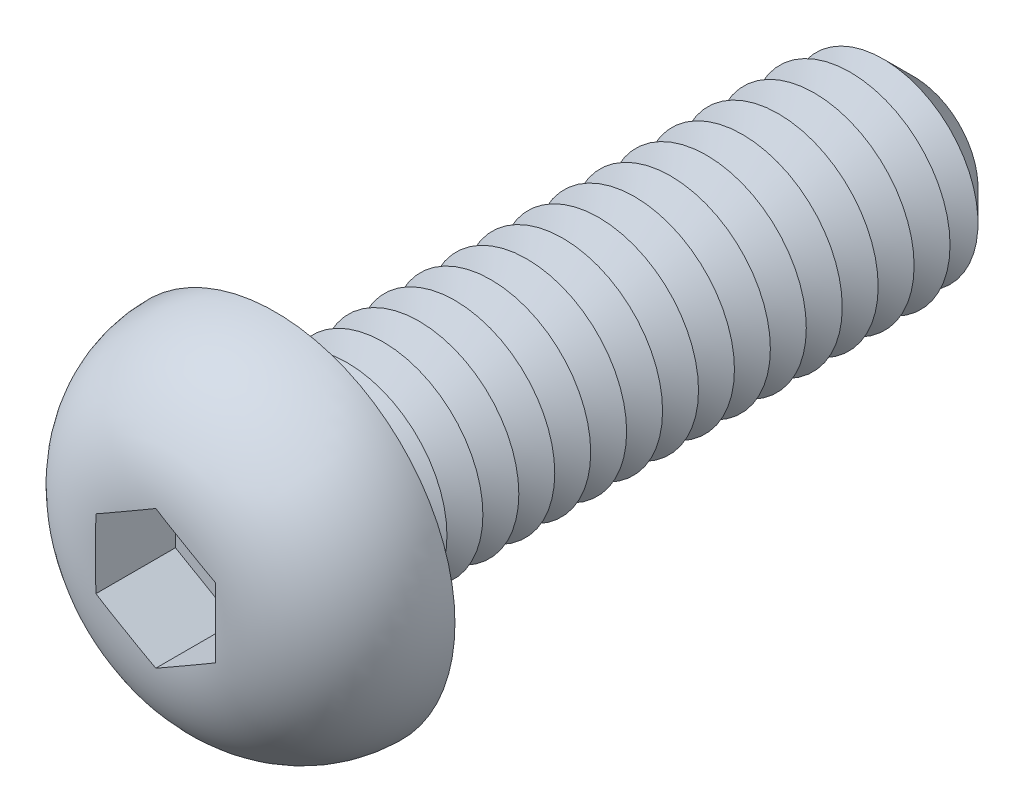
ISO-10303-21;
HEADER;
FILE_DESCRIPTION(('STEP AP214'),'2;1');
FILE_NAME('part.step','',(''),(''),'','','');
FILE_SCHEMA(('AUTOMOTIVE_DESIGN { 1 0 10303 214 1 1 1 1 }'));
ENDSEC;
DATA;
#1=APPLICATION_CONTEXT('core data for automotive mechanical design processes');
#2=APPLICATION_PROTOCOL_DEFINITION('international standard','automotive_design',2000,#1);
#3=PRODUCT_CONTEXT('',#1,'mechanical');
#4=PRODUCT('Part','Part','',(#3));
#5=PRODUCT_RELATED_PRODUCT_CATEGORY('part','',(#4));
#6=PRODUCT_DEFINITION_FORMATION('','',#4);
#7=PRODUCT_DEFINITION_CONTEXT('part definition',#1,'design');
#8=PRODUCT_DEFINITION('design','',#6,#7);
#9=PRODUCT_DEFINITION_SHAPE('','',#8);
#10=(LENGTH_UNIT() NAMED_UNIT(*) SI_UNIT(.MILLI.,.METRE.));
#11=(NAMED_UNIT(*) PLANE_ANGLE_UNIT() SI_UNIT($,.RADIAN.));
#12=(NAMED_UNIT(*) SI_UNIT($,.STERADIAN.) SOLID_ANGLE_UNIT());
#13=UNCERTAINTY_MEASURE_WITH_UNIT(LENGTH_MEASURE(1.E-05),#10,'distance_accuracy_value','');
#14=(GEOMETRIC_REPRESENTATION_CONTEXT(3) GLOBAL_UNCERTAINTY_ASSIGNED_CONTEXT((#13)) GLOBAL_UNIT_ASSIGNED_CONTEXT((#10,
#11,#12)) REPRESENTATION_CONTEXT('',''));
#15=CARTESIAN_POINT('',(0.,0.,0.));
#16=DIRECTION('',(0.,0.,1.));
#17=DIRECTION('',(1.,0.,0.));
#18=AXIS2_PLACEMENT_3D('',#15,#16,#17);
#19=CARTESIAN_POINT('',(0.,0.,-8.));
#20=DIRECTION('',(0.,0.,1.));
#21=DIRECTION('',(1.,0.,0.));
#22=AXIS2_PLACEMENT_3D('',#19,#20,#21);
#23=CYLINDRICAL_SURFACE('',#22,1.25);
#24=CARTESIAN_POINT('',(0.,0.,-0.225));
#25=DIRECTION('',(0.,0.,1.));
#26=DIRECTION('',(1.,0.,0.));
#27=AXIS2_PLACEMENT_3D('',#24,#25,#26);
#28=CIRCLE('',#27,1.25);
#29=CARTESIAN_POINT('',(1.25,0.,-0.225));
#30=VERTEX_POINT('',#29);
#31=EDGE_CURVE('E48',#30,#30,#28,.F.);
#32=ORIENTED_EDGE('',*,*,#31,.T.);
#33=EDGE_LOOP('',(#32));
#34=FACE_BOUND('',#33,.T.);
#35=CARTESIAN_POINT('',(0.,0.,-0.449999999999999));
#36=DIRECTION('',(0.,0.,1.));
#37=DIRECTION('',(1.,0.,0.));
#38=AXIS2_PLACEMENT_3D('',#35,#36,#37);
#39=CIRCLE('',#38,1.25);
#40=CARTESIAN_POINT('',(1.25,0.,-0.449999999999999));
#41=VERTEX_POINT('',#40);
#42=EDGE_CURVE('E116',#41,#41,#39,.T.);
#43=ORIENTED_EDGE('',*,*,#42,.T.);
#44=EDGE_LOOP('',(#43));
#45=FACE_BOUND('',#44,.T.);
#46=ADVANCED_FACE('F39',(#34,#45),#23,.T.);
#47=CARTESIAN_POINT('',(0.,2.25,0.));
#48=DIRECTION('',(0.,0.,1.));
#49=DIRECTION('',(1.,0.,0.));
#50=AXIS2_PLACEMENT_3D('',#47,#48,#49);
#51=PLANE('',#50);
#52=CARTESIAN_POINT('',(0.,0.,0.));
#53=DIRECTION('',(0.,0.,1.));
#54=DIRECTION('',(1.,0.,0.));
#55=AXIS2_PLACEMENT_3D('',#52,#53,#54);
#56=CIRCLE('',#55,1.475);
#57=CARTESIAN_POINT('',(1.475,0.,0.));
#58=VERTEX_POINT('',#57);
#59=EDGE_CURVE('E11',#58,#58,#56,.T.);
#60=ORIENTED_EDGE('',*,*,#59,.T.);
#61=EDGE_LOOP('',(#60));
#62=FACE_BOUND('',#61,.T.);
#63=CARTESIAN_POINT('',(0.,0.,0.));
#64=DIRECTION('',(0.,0.,1.));
#65=DIRECTION('',(1.,0.,0.));
#66=AXIS2_PLACEMENT_3D('',#63,#64,#65);
#67=CIRCLE('',#66,2.25);
#68=CARTESIAN_POINT('',(2.25,0.,0.));
#69=VERTEX_POINT('',#68);
#70=EDGE_CURVE('E139',#69,#69,#67,.T.);
#71=ORIENTED_EDGE('',*,*,#70,.F.);
#72=EDGE_LOOP('',(#71));
#73=FACE_BOUND('',#72,.T.);
#74=ADVANCED_FACE('F249',(#62,#73),#51,.F.);
#75=CARTESIAN_POINT('',(0.,0.,0.));
#76=DIRECTION('',(0.,0.,1.));
#77=DIRECTION('',(1.,0.,0.));
#78=AXIS2_PLACEMENT_3D('',#75,#76,#77);
#79=DEGENERATE_TOROIDAL_SURFACE('',#78,0.75,1.5,.T.);
#80=CARTESIAN_POINT('',(-0.00020000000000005,0.866140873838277,1.49549700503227));
#81=CARTESIAN_POINT('',(0.0310550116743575,0.848095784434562,1.4968946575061));
#82=CARTESIAN_POINT('',(0.0623199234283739,0.83004497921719,1.49783965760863));
#83=CARTESIAN_POINT('',(0.124855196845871,0.793940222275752,1.49913317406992));
#84=CARTESIAN_POINT('',(0.156125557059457,0.775886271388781,1.49948177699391));
#85=CARTESIAN_POINT('',(0.218662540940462,0.739780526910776,1.49989152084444));
#86=CARTESIAN_POINT('',(0.249929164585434,0.7217287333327,1.49995269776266));
#87=CARTESIAN_POINT('',(0.312463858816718,0.685624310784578,1.50000693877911));
#88=CARTESIAN_POINT('',(0.343731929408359,0.667571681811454,1.5));
#89=CARTESIAN_POINT('',(0.40626807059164,0.631466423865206,1.5));
#90=CARTESIAN_POINT('',(0.437536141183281,0.613413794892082,1.50000693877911));
#91=CARTESIAN_POINT('',(0.500070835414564,0.577309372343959,1.49995269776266));
#92=CARTESIAN_POINT('',(0.531337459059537,0.559257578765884,1.49989152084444));
#93=CARTESIAN_POINT('',(0.593874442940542,0.523151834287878,1.49948177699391));
#94=CARTESIAN_POINT('',(0.625144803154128,0.505097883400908,1.49913317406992));
#95=CARTESIAN_POINT('',(0.687680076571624,0.468993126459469,1.49783965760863));
#96=CARTESIAN_POINT('',(0.718944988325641,0.450942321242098,1.49689465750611));
#97=CARTESIAN_POINT('',(0.750199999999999,0.432897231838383,1.4954970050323));
#98=B_SPLINE_CURVE_WITH_KNOTS('',3,(#80,#81,#82,#83,#84,#85,#86,#87,#88,#89,#90,#91,#92,#93,#94,
#95,#96,#97),.UNSPECIFIED.,.F.,.F.,(4,2,2,2,2,2,2,2,4),(0.,0.108340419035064,0.216665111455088,
0.324976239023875,0.433291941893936,0.541607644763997,0.649918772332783,0.758243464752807,
0.866583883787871),.UNSPECIFIED.);
#99=CARTESIAN_POINT('',(0.,0.866025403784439,1.49550596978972));
#100=VERTEX_POINT('',#99);
#101=CARTESIAN_POINT('',(0.75,0.43301270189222,1.49550596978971));
#102=VERTEX_POINT('',#101);
#103=EDGE_CURVE('E62',#100,#102,#98,.T.);
#104=ORIENTED_EDGE('',*,*,#103,.T.);
#105=CARTESIAN_POINT('',(0.75,0.,1.5));
#106=CARTESIAN_POINT('',(0.75,-0.0627080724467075,1.50000006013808));
#107=CARTESIAN_POINT('',(0.75,-0.125416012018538,1.50006294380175));
#108=CARTESIAN_POINT('',(0.75,-0.250852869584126,1.49957707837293));
#109=CARTESIAN_POINT('',(0.75,-0.313581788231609,1.49902814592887));
#110=CARTESIAN_POINT('',(0.75,-0.438802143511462,1.49567950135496));
#111=CARTESIAN_POINT('',(0.75,-0.501293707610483,1.49288685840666));
#112=CARTESIAN_POINT('',(0.75,-0.625982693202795,1.48341085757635));
#113=CARTESIAN_POINT('',(0.75,-0.688180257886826,1.47672964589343));
#114=CARTESIAN_POINT('',(0.75,-0.798866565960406,1.46016399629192));
#115=CARTESIAN_POINT('',(0.75,-0.847497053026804,1.45124406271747));
#116=CARTESIAN_POINT('',(0.75,-0.943962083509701,1.42976864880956));
#117=CARTESIAN_POINT('',(0.75,-0.991796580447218,1.41721295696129));
#118=CARTESIAN_POINT('',(0.75,-1.08630476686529,1.38817887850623));
#119=CARTESIAN_POINT('',(0.75,-1.13297775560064,1.37169818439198));
#120=CARTESIAN_POINT('',(0.75,-1.22469462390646,1.33469293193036));
#121=CARTESIAN_POINT('',(0.75,-1.26973805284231,1.31416726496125));
#122=CARTESIAN_POINT('',(0.75,-1.40247100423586,1.24607127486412));
#123=CARTESIAN_POINT('',(0.750000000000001,-1.48705462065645,1.19219273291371));
#124=CARTESIAN_POINT('',(0.750000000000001,-1.64393724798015,1.06881737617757));
#125=CARTESIAN_POINT('',(0.750000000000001,-1.71623917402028,0.99932427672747));
#126=CARTESIAN_POINT('',(0.750000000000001,-1.83613547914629,0.857842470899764));
#127=CARTESIAN_POINT('',(0.750000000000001,-1.88577468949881,0.787579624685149));
#128=CARTESIAN_POINT('',(0.750000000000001,-1.97175648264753,0.639365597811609));
#129=CARTESIAN_POINT('',(0.750000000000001,-2.00810707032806,0.56141908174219));
#130=CARTESIAN_POINT('',(0.750000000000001,-2.06466924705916,0.404589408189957));
#131=CARTESIAN_POINT('',(0.750000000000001,-2.08563938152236,0.325978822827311));
#132=CARTESIAN_POINT('',(0.750000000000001,-2.11383941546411,0.166329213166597));
#133=CARTESIAN_POINT('',(0.750000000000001,-2.12107071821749,0.0852904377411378));
#134=CARTESIAN_POINT('',(0.750000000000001,-2.12155325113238,-0.0754758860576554));
#135=CARTESIAN_POINT('',(0.750000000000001,-2.11503465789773,-0.155202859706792));
#136=CARTESIAN_POINT('',(0.750000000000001,-2.08869127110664,-0.312426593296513));
#137=CARTESIAN_POINT('',(0.750000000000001,-2.06886647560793,-0.389923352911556));
#138=CARTESIAN_POINT('',(0.750000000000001,-2.01655236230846,-0.540457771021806));
#139=CARTESIAN_POINT('',(0.750000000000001,-1.98407088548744,-0.613498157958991));
#140=CARTESIAN_POINT('',(0.750000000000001,-1.9074704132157,-0.753167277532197));
#141=CARTESIAN_POINT('',(0.750000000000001,-1.86335369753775,-0.81979726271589));
#142=CARTESIAN_POINT('',(0.750000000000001,-1.76418094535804,-0.945786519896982));
#143=CARTESIAN_POINT('',(0.750000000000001,-1.70898715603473,-1.00503724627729));
#144=CARTESIAN_POINT('',(0.750000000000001,-1.58971135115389,-1.11387170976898));
#145=CARTESIAN_POINT('',(0.75,-1.52562045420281,-1.16344566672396));
#146=CARTESIAN_POINT('',(0.75,-1.38780810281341,-1.25370948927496));
#147=CARTESIAN_POINT('',(0.75,-1.31380696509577,-1.29397311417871));
#148=CARTESIAN_POINT('',(0.75,-1.19908931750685,-1.34544517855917));
#149=CARTESIAN_POINT('',(0.75,-1.16029271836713,-1.36109820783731));
#150=CARTESIAN_POINT('',(0.75,-1.08166825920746,-1.38954640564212));
#151=CARTESIAN_POINT('',(0.75,-1.04184052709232,-1.40234192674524));
#152=CARTESIAN_POINT('',(0.75,-0.922724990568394,-1.43614112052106));
#153=CARTESIAN_POINT('',(0.75,-0.842305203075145,-1.45321262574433));
#154=CARTESIAN_POINT('',(0.75,-0.680054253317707,-1.47833811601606));
#155=CARTESIAN_POINT('',(0.75,-0.598220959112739,-1.48637700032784));
#156=CARTESIAN_POINT('',(0.75,-0.432952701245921,-1.4964806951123));
#157=CARTESIAN_POINT('',(0.75,-0.349513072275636,-1.49844778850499));
#158=CARTESIAN_POINT('',(0.75,-0.224384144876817,-1.49972680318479));
#159=CARTESIAN_POINT('',(0.75,-0.182687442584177,-1.49987466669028));
#160=CARTESIAN_POINT('',(0.75,-0.0992944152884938,-1.50001027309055));
#161=CARTESIAN_POINT('',(0.75,-0.0575980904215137,-1.49999802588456));
#162=CARTESIAN_POINT('',(0.75,0.0343362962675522,-1.50000235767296));
#163=CARTESIAN_POINT('',(0.75,0.0845742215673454,-1.50002535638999));
#164=CARTESIAN_POINT('',(0.75,0.185055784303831,-1.49987831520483));
#165=CARTESIAN_POINT('',(0.75,0.235299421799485,-1.49970825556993));
#166=CARTESIAN_POINT('',(0.75,0.335816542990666,-1.49845206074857));
#167=CARTESIAN_POINT('',(0.75,0.386090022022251,-1.49736526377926));
#168=CARTESIAN_POINT('',(0.75,0.486569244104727,-1.49338674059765));
#169=CARTESIAN_POINT('',(0.75,0.536774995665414,-1.49049526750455));
#170=CARTESIAN_POINT('',(0.75,0.636034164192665,-1.4821682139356));
#171=CARTESIAN_POINT('',(0.75,0.685091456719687,-1.47678164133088));
#172=CARTESIAN_POINT('',(0.75,0.78275573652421,-1.46286947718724));
#173=CARTESIAN_POINT('',(0.75,0.831362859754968,-1.45434486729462));
#174=CARTESIAN_POINT('',(0.75,0.92771552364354,-1.43373454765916));
#175=CARTESIAN_POINT('',(0.75,0.975462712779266,-1.42165664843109));
#176=CARTESIAN_POINT('',(0.75,1.06980144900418,-1.39365234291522));
#177=CARTESIAN_POINT('',(0.75,1.11639353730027,-1.37772777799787));
#178=CARTESIAN_POINT('',(0.75,1.20164461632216,-1.3443737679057));
#179=CARTESIAN_POINT('',(0.75,1.24050600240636,-1.32746129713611));
#180=CARTESIAN_POINT('',(0.75,1.31679530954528,-1.29064565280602));
#181=CARTESIAN_POINT('',(0.75,1.35422305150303,-1.27074210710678));
#182=CARTESIAN_POINT('',(0.75,1.42755003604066,-1.22785786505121));
#183=CARTESIAN_POINT('',(0.75,1.46343995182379,-1.20486115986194));
#184=CARTESIAN_POINT('',(0.75,1.53317270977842,-1.15597138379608));
#185=CARTESIAN_POINT('',(0.75,1.56701570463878,-1.1300785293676));
#186=CARTESIAN_POINT('',(0.75,1.66513078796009,-1.04815589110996));
#187=CARTESIAN_POINT('',(0.75,1.72596640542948,-0.987895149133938));
#188=CARTESIAN_POINT('',(0.75,1.83611610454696,-0.857815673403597));
#189=CARTESIAN_POINT('',(0.75,1.88544739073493,-0.78801146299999));
#190=CARTESIAN_POINT('',(0.75,1.96970141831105,-0.64303465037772));
#191=CARTESIAN_POINT('',(0.75,2.00501928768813,-0.568092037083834));
#192=CARTESIAN_POINT('',(0.75,2.06216371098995,-0.413201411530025));
#193=CARTESIAN_POINT('',(0.75,2.08398748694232,-0.333252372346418));
#194=CARTESIAN_POINT('',(0.75,2.11297506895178,-0.173098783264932));
#195=CARTESIAN_POINT('',(0.75,2.12053880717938,-0.0929664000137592));
#196=CARTESIAN_POINT('',(0.75,2.1219864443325,0.0674127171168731));
#197=CARTESIAN_POINT('',(0.75,2.1158724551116,0.147659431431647));
#198=CARTESIAN_POINT('',(0.75,2.09026719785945,0.305329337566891));
#199=CARTESIAN_POINT('',(0.75,2.07088260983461,0.382769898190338));
#200=CARTESIAN_POINT('',(0.75,2.01945905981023,0.53332273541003));
#201=CARTESIAN_POINT('',(0.75,1.98742024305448,0.606435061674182));
#202=CARTESIAN_POINT('',(0.75,1.91146692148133,0.746751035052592));
#203=CARTESIAN_POINT('',(0.75,1.86748433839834,0.813917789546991));
#204=CARTESIAN_POINT('',(0.75,1.76910058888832,0.940116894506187));
#205=CARTESIAN_POINT('',(0.75,1.71469868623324,0.999148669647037));
#206=CARTESIAN_POINT('',(0.75,1.59577189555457,1.10896258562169));
#207=CARTESIAN_POINT('',(0.75,1.53104176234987,1.15952203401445));
#208=CARTESIAN_POINT('',(0.75,1.3944150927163,1.24972990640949));
#209=CARTESIAN_POINT('',(0.75,1.32251811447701,1.28937765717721));
#210=CARTESIAN_POINT('',(0.75,1.16914901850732,1.35951213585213));
#211=CARTESIAN_POINT('',(0.75,1.08736098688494,1.38930295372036));
#212=CARTESIAN_POINT('',(0.75,0.920496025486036,1.43689243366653));
#213=CARTESIAN_POINT('',(0.75,0.835420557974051,1.45469636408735));
#214=CARTESIAN_POINT('',(0.75,0.687870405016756,1.476773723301));
#215=CARTESIAN_POINT('',(0.75,0.625720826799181,1.48343749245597));
#216=CARTESIAN_POINT('',(0.75,0.501109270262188,1.49289411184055));
#217=CARTESIAN_POINT('',(0.75,0.438647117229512,1.49568447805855));
#218=CARTESIAN_POINT('',(0.75,0.313477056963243,1.49903009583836));
#219=CARTESIAN_POINT('',(0.75,0.250769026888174,1.49957783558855));
#220=CARTESIAN_POINT('',(0.75,0.125373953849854,1.50006266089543));
#221=CARTESIAN_POINT('',(0.75,0.0626869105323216,1.49999993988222));
#222=CARTESIAN_POINT('',(0.75,0.,1.5));
#223=B_SPLINE_CURVE_WITH_KNOTS('',3,(#105,#106,#107,#108,#109,#110,#111,#112,#113,#114,#115,
#116,#117,#118,#119,#120,#121,#122,#123,#124,#125,#126,#127,#128,#129,#130,#131,#132,#133,#134,
#135,#136,#137,#138,#139,#140,#141,#142,#143,#144,#145,#146,#147,#148,#149,#150,#151,#152,#153,
#154,#155,#156,#157,#158,#159,#160,#161,#162,#163,#164,#165,#166,#167,#168,#169,#170,#171,#172,
#173,#174,#175,#176,#177,#178,#179,#180,#181,#182,#183,#184,#185,#186,#187,#188,#189,#190,#191,
#192,#193,#194,#195,#196,#197,#198,#199,#200,#201,#202,#203,#204,#205,#206,#207,#208,#209,#210,
#211,#212,#213,#214,#215,#216,#217,#218,#219,#220,#221,#222),.UNSPECIFIED.,.T.,.F.,(4,2,2,2,2,2,
2,2,2,2,2,2,2,2,2,2,2,2,2,2,2,2,2,2,2,2,2,2,2,2,2,2,2,2,2,2,2,2,2,2,2,2,2,2,2,2,2,2,2,2,2,2,2,2,
2,2,2,2,4),(0.,0.188125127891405,0.376306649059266,0.563897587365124,0.75138508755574,
0.899588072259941,1.04779968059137,1.19609863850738,1.34443829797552,1.64330264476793,
1.94209595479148,2.19886247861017,2.45547407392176,2.69837467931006,2.94125047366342,
3.18009276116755,3.418935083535,3.65762967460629,3.89627753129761,4.13810096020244,
4.38016754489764,4.63175737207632,4.75717060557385,4.88256835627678,5.12849835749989,
5.37483889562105,5.62512380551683,5.75021912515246,5.87530671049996,6.02602122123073,
6.17675113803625,6.32758995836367,6.47840762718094,6.62638101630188,6.77430815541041,
6.92191253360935,7.06944639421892,7.19647012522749,7.32350967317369,7.4512340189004,
7.57894882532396,7.83445576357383,8.08957810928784,8.33688433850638,8.58424146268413,
8.82455168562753,9.06482480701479,9.30318875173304,9.54154996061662,9.781299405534,
10.0210657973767,10.266384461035,10.511718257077,10.7718340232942,11.0318353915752,
11.219209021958,11.4067027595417,11.5948240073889,11.7828856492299),.UNSPECIFIED.);
#224=CARTESIAN_POINT('',(0.75,-0.43301270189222,1.49550596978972));
#225=VERTEX_POINT('',#224);
#226=EDGE_CURVE('E214',#102,#225,#223,.T.);
#227=ORIENTED_EDGE('',*,*,#226,.T.);
#228=CARTESIAN_POINT('',(0.7502,-0.432897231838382,1.49549700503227));
#229=CARTESIAN_POINT('',(0.718944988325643,-0.450942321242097,1.4968946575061));
#230=CARTESIAN_POINT('',(0.687680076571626,-0.468993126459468,1.49783965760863));
#231=CARTESIAN_POINT('',(0.625144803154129,-0.505097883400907,1.49913317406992));
#232=CARTESIAN_POINT('',(0.593874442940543,-0.523151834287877,1.49948177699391));
#233=CARTESIAN_POINT('',(0.531337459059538,-0.559257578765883,1.49989152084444));
#234=CARTESIAN_POINT('',(0.500070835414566,-0.577309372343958,1.49995269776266));
#235=CARTESIAN_POINT('',(0.437536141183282,-0.613413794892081,1.50000693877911));
#236=CARTESIAN_POINT('',(0.406268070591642,-0.631466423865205,1.5));
#237=CARTESIAN_POINT('',(0.34373192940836,-0.667571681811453,1.5));
#238=CARTESIAN_POINT('',(0.312463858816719,-0.685624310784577,1.50000693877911));
#239=CARTESIAN_POINT('',(0.249929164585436,-0.721728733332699,1.49995269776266));
#240=CARTESIAN_POINT('',(0.218662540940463,-0.739780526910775,1.49989152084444));
#241=CARTESIAN_POINT('',(0.156125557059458,-0.77588627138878,1.49948177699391));
#242=CARTESIAN_POINT('',(0.124855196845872,-0.793940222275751,1.49913317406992));
#243=CARTESIAN_POINT('',(0.0623199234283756,-0.830044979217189,1.49783965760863));
#244=CARTESIAN_POINT('',(0.0310550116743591,-0.848095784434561,1.49689465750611));
#245=CARTESIAN_POINT('',(-0.000199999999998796,-0.866140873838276,1.4954970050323));
#246=B_SPLINE_CURVE_WITH_KNOTS('',3,(#228,#229,#230,#231,#232,#233,#234,#235,#236,#237,#238,
#239,#240,#241,#242,#243,#244,#245),.UNSPECIFIED.,.F.,.F.,(4,2,2,2,2,2,2,2,4),(0.,
0.108340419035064,0.216665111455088,0.324976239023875,0.433291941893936,0.541607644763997,
0.649918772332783,0.758243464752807,0.866583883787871),.UNSPECIFIED.);
#247=CARTESIAN_POINT('',(0.,-0.866025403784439,1.49550596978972));
#248=VERTEX_POINT('',#247);
#249=EDGE_CURVE('E194',#225,#248,#246,.T.);
#250=ORIENTED_EDGE('',*,*,#249,.T.);
#251=CARTESIAN_POINT('',(0.000200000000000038,-0.866140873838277,1.49549700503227));
#252=CARTESIAN_POINT('',(-0.0310550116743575,-0.848095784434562,1.4968946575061));
#253=CARTESIAN_POINT('',(-0.0623199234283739,-0.83004497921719,1.49783965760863));
#254=CARTESIAN_POINT('',(-0.124855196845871,-0.793940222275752,1.49913317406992));
#255=CARTESIAN_POINT('',(-0.156125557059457,-0.775886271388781,1.49948177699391));
#256=CARTESIAN_POINT('',(-0.218662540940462,-0.739780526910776,1.49989152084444));
#257=CARTESIAN_POINT('',(-0.249929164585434,-0.7217287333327,1.49995269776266));
#258=CARTESIAN_POINT('',(-0.312463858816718,-0.685624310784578,1.50000693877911));
#259=CARTESIAN_POINT('',(-0.343731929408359,-0.667571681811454,1.5));
#260=CARTESIAN_POINT('',(-0.40626807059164,-0.631466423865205,1.5));
#261=CARTESIAN_POINT('',(-0.437536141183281,-0.613413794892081,1.50000693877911));
#262=CARTESIAN_POINT('',(-0.500070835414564,-0.577309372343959,1.49995269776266));
#263=CARTESIAN_POINT('',(-0.531337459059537,-0.559257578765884,1.49989152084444));
#264=CARTESIAN_POINT('',(-0.593874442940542,-0.523151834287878,1.49948177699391));
#265=CARTESIAN_POINT('',(-0.625144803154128,-0.505097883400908,1.49913317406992));
#266=CARTESIAN_POINT('',(-0.687680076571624,-0.468993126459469,1.49783965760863));
#267=CARTESIAN_POINT('',(-0.718944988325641,-0.450942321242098,1.49689465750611));
#268=CARTESIAN_POINT('',(-0.750199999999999,-0.432897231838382,1.4954970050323));
#269=B_SPLINE_CURVE_WITH_KNOTS('',3,(#251,#252,#253,#254,#255,#256,#257,#258,#259,#260,#261,
#262,#263,#264,#265,#266,#267,#268),.UNSPECIFIED.,.F.,.F.,(4,2,2,2,2,2,2,2,4),(0.,
0.108340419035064,0.216665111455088,0.324976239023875,0.433291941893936,0.541607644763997,
0.649918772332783,0.758243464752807,0.866583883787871),.UNSPECIFIED.);
#270=CARTESIAN_POINT('',(-0.75,-0.433012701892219,1.49550596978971));
#271=VERTEX_POINT('',#270);
#272=EDGE_CURVE('E187',#248,#271,#269,.T.);
#273=ORIENTED_EDGE('',*,*,#272,.T.);
#274=CARTESIAN_POINT('',(-0.75,0.,1.5));
#275=CARTESIAN_POINT('',(-0.75,0.0627080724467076,1.50000006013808));
#276=CARTESIAN_POINT('',(-0.75,0.125416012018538,1.50006294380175));
#277=CARTESIAN_POINT('',(-0.75,0.250852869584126,1.49957707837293));
#278=CARTESIAN_POINT('',(-0.75,0.313581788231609,1.49902814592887));
#279=CARTESIAN_POINT('',(-0.75,0.438802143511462,1.49567950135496));
#280=CARTESIAN_POINT('',(-0.75,0.501293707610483,1.49288685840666));
#281=CARTESIAN_POINT('',(-0.75,0.625982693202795,1.48341085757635));
#282=CARTESIAN_POINT('',(-0.75,0.688180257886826,1.47672964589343));
#283=CARTESIAN_POINT('',(-0.75,0.798866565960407,1.46016399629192));
#284=CARTESIAN_POINT('',(-0.75,0.847497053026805,1.45124406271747));
#285=CARTESIAN_POINT('',(-0.75,0.943962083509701,1.42976864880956));
#286=CARTESIAN_POINT('',(-0.75,0.991796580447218,1.41721295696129));
#287=CARTESIAN_POINT('',(-0.75,1.08630476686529,1.38817887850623));
#288=CARTESIAN_POINT('',(-0.75,1.13297775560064,1.37169818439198));
#289=CARTESIAN_POINT('',(-0.75,1.22469462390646,1.33469293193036));
#290=CARTESIAN_POINT('',(-0.75,1.26973805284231,1.31416726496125));
#291=CARTESIAN_POINT('',(-0.75,1.40247100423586,1.24607127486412));
#292=CARTESIAN_POINT('',(-0.75,1.48705462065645,1.19219273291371));
#293=CARTESIAN_POINT('',(-0.75,1.64393724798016,1.06881737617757));
#294=CARTESIAN_POINT('',(-0.75,1.71623917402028,0.99932427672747));
#295=CARTESIAN_POINT('',(-0.75,1.83613547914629,0.857842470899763));
#296=CARTESIAN_POINT('',(-0.75,1.88577468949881,0.787579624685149));
#297=CARTESIAN_POINT('',(-0.75,1.97175648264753,0.639365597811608));
#298=CARTESIAN_POINT('',(-0.75,2.00810707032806,0.561419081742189));
#299=CARTESIAN_POINT('',(-0.75,2.06466924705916,0.404589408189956));
#300=CARTESIAN_POINT('',(-0.75,2.08563938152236,0.325978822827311));
#301=CARTESIAN_POINT('',(-0.75,2.11383941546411,0.166329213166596));
#302=CARTESIAN_POINT('',(-0.75,2.12107071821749,0.0852904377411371));
#303=CARTESIAN_POINT('',(-0.75,2.12155325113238,-0.0754758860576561));
#304=CARTESIAN_POINT('',(-0.75,2.11503465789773,-0.155202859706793));
#305=CARTESIAN_POINT('',(-0.75,2.08869127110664,-0.312426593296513));
#306=CARTESIAN_POINT('',(-0.75,2.06886647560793,-0.389923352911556));
#307=CARTESIAN_POINT('',(-0.75,2.01655236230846,-0.540457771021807));
#308=CARTESIAN_POINT('',(-0.75,1.98407088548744,-0.613498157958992));
#309=CARTESIAN_POINT('',(-0.75,1.9074704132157,-0.753167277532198));
#310=CARTESIAN_POINT('',(-0.75,1.86335369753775,-0.81979726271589));
#311=CARTESIAN_POINT('',(-0.75,1.76418094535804,-0.945786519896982));
#312=CARTESIAN_POINT('',(-0.75,1.70898715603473,-1.00503724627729));
#313=CARTESIAN_POINT('',(-0.75,1.58971135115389,-1.11387170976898));
#314=CARTESIAN_POINT('',(-0.75,1.52562045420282,-1.16344566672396));
#315=CARTESIAN_POINT('',(-0.75,1.38780810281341,-1.25370948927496));
#316=CARTESIAN_POINT('',(-0.75,1.31380696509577,-1.29397311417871));
#317=CARTESIAN_POINT('',(-0.75,1.19908931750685,-1.34544517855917));
#318=CARTESIAN_POINT('',(-0.75,1.16029271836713,-1.36109820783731));
#319=CARTESIAN_POINT('',(-0.75,1.08166825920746,-1.38954640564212));
#320=CARTESIAN_POINT('',(-0.75,1.04184052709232,-1.40234192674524));
#321=CARTESIAN_POINT('',(-0.75,0.922724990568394,-1.43614112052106));
#322=CARTESIAN_POINT('',(-0.75,0.842305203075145,-1.45321262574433));
#323=CARTESIAN_POINT('',(-0.75,0.680054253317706,-1.47833811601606));
#324=CARTESIAN_POINT('',(-0.75,0.598220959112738,-1.48637700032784));
#325=CARTESIAN_POINT('',(-0.75,0.43295270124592,-1.4964806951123));
#326=CARTESIAN_POINT('',(-0.75,0.349513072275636,-1.49844778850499));
#327=CARTESIAN_POINT('',(-0.75,0.224384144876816,-1.49972680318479));
#328=CARTESIAN_POINT('',(-0.75,0.182687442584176,-1.49987466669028));
#329=CARTESIAN_POINT('',(-0.75,0.0992944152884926,-1.50001027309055));
#330=CARTESIAN_POINT('',(-0.75,0.0575980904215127,-1.49999802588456));
#331=CARTESIAN_POINT('',(-0.75,-0.0343362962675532,-1.50000235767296));
#332=CARTESIAN_POINT('',(-0.75,-0.0845742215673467,-1.50002535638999));
#333=CARTESIAN_POINT('',(-0.75,-0.185055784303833,-1.49987831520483));
#334=CARTESIAN_POINT('',(-0.75,-0.235299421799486,-1.49970825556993));
#335=CARTESIAN_POINT('',(-0.75,-0.335816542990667,-1.49845206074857));
#336=CARTESIAN_POINT('',(-0.75,-0.386090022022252,-1.49736526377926));
#337=CARTESIAN_POINT('',(-0.75,-0.486569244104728,-1.49338674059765));
#338=CARTESIAN_POINT('',(-0.75,-0.536774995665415,-1.49049526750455));
#339=CARTESIAN_POINT('',(-0.75,-0.636034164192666,-1.4821682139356));
#340=CARTESIAN_POINT('',(-0.75,-0.685091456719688,-1.47678164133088));
#341=CARTESIAN_POINT('',(-0.75,-0.782755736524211,-1.46286947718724));
#342=CARTESIAN_POINT('',(-0.75,-0.831362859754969,-1.45434486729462));
#343=CARTESIAN_POINT('',(-0.75,-0.927715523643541,-1.43373454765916));
#344=CARTESIAN_POINT('',(-0.75,-0.975462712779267,-1.42165664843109));
#345=CARTESIAN_POINT('',(-0.75,-1.06980144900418,-1.39365234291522));
#346=CARTESIAN_POINT('',(-0.75,-1.11639353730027,-1.37772777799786));
#347=CARTESIAN_POINT('',(-0.75,-1.20164461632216,-1.3443737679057));
#348=CARTESIAN_POINT('',(-0.75,-1.24050600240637,-1.32746129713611));
#349=CARTESIAN_POINT('',(-0.75,-1.31679530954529,-1.29064565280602));
#350=CARTESIAN_POINT('',(-0.75,-1.35422305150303,-1.27074210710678));
#351=CARTESIAN_POINT('',(-0.75,-1.42755003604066,-1.22785786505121));
#352=CARTESIAN_POINT('',(-0.75,-1.46343995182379,-1.20486115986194));
#353=CARTESIAN_POINT('',(-0.75,-1.53317270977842,-1.15597138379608));
#354=CARTESIAN_POINT('',(-0.75,-1.56701570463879,-1.1300785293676));
#355=CARTESIAN_POINT('',(-0.75,-1.66513078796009,-1.04815589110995));
#356=CARTESIAN_POINT('',(-0.75,-1.72596640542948,-0.987895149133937));
#357=CARTESIAN_POINT('',(-0.75,-1.83611610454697,-0.857815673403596));
#358=CARTESIAN_POINT('',(-0.75,-1.88544739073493,-0.788011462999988));
#359=CARTESIAN_POINT('',(-0.75,-1.96970141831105,-0.643034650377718));
#360=CARTESIAN_POINT('',(-0.75,-2.00501928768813,-0.568092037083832));
#361=CARTESIAN_POINT('',(-0.75,-2.06216371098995,-0.413201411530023));
#362=CARTESIAN_POINT('',(-0.75,-2.08398748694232,-0.333252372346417));
#363=CARTESIAN_POINT('',(-0.75,-2.11297506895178,-0.173098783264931));
#364=CARTESIAN_POINT('',(-0.75,-2.12053880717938,-0.0929664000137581));
#365=CARTESIAN_POINT('',(-0.75,-2.1219864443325,0.0674127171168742));
#366=CARTESIAN_POINT('',(-0.75,-2.1158724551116,0.147659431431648));
#367=CARTESIAN_POINT('',(-0.75,-2.09026719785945,0.305329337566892));
#368=CARTESIAN_POINT('',(-0.75,-2.07088260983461,0.382769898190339));
#369=CARTESIAN_POINT('',(-0.75,-2.01945905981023,0.533322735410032));
#370=CARTESIAN_POINT('',(-0.75,-1.98742024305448,0.606435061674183));
#371=CARTESIAN_POINT('',(-0.75,-1.91146692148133,0.746751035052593));
#372=CARTESIAN_POINT('',(-0.75,-1.86748433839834,0.813917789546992));
#373=CARTESIAN_POINT('',(-0.75,-1.76910058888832,0.940116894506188));
#374=CARTESIAN_POINT('',(-0.75,-1.71469868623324,0.999148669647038));
#375=CARTESIAN_POINT('',(-0.75,-1.59577189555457,1.10896258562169));
#376=CARTESIAN_POINT('',(-0.75,-1.53104176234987,1.15952203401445));
#377=CARTESIAN_POINT('',(-0.75,-1.3944150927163,1.24972990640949));
#378=CARTESIAN_POINT('',(-0.75,-1.32251811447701,1.28937765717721));
#379=CARTESIAN_POINT('',(-0.75,-1.16914901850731,1.35951213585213));
#380=CARTESIAN_POINT('',(-0.75,-1.08736098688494,1.38930295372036));
#381=CARTESIAN_POINT('',(-0.75,-0.920496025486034,1.43689243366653));
#382=CARTESIAN_POINT('',(-0.75,-0.83542055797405,1.45469636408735));
#383=CARTESIAN_POINT('',(-0.75,-0.687870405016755,1.476773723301));
#384=CARTESIAN_POINT('',(-0.75,-0.625720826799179,1.48343749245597));
#385=CARTESIAN_POINT('',(-0.75,-0.501109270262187,1.49289411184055));
#386=CARTESIAN_POINT('',(-0.75,-0.438647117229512,1.49568447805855));
#387=CARTESIAN_POINT('',(-0.75,-0.313477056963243,1.49903009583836));
#388=CARTESIAN_POINT('',(-0.75,-0.250769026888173,1.49957783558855));
#389=CARTESIAN_POINT('',(-0.75,-0.125373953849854,1.50006266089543));
#390=CARTESIAN_POINT('',(-0.75,-0.0626869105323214,1.49999993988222));
#391=CARTESIAN_POINT('',(-0.75,0.,1.5));
#392=B_SPLINE_CURVE_WITH_KNOTS('',3,(#274,#275,#276,#277,#278,#279,#280,#281,#282,#283,#284,
#285,#286,#287,#288,#289,#290,#291,#292,#293,#294,#295,#296,#297,#298,#299,#300,#301,#302,#303,
#304,#305,#306,#307,#308,#309,#310,#311,#312,#313,#314,#315,#316,#317,#318,#319,#320,#321,#322,
#323,#324,#325,#326,#327,#328,#329,#330,#331,#332,#333,#334,#335,#336,#337,#338,#339,#340,#341,
#342,#343,#344,#345,#346,#347,#348,#349,#350,#351,#352,#353,#354,#355,#356,#357,#358,#359,#360,
#361,#362,#363,#364,#365,#366,#367,#368,#369,#370,#371,#372,#373,#374,#375,#376,#377,#378,#379,
#380,#381,#382,#383,#384,#385,#386,#387,#388,#389,#390,#391),.UNSPECIFIED.,.T.,.F.,(4,2,2,2,2,2,
2,2,2,2,2,2,2,2,2,2,2,2,2,2,2,2,2,2,2,2,2,2,2,2,2,2,2,2,2,2,2,2,2,2,2,2,2,2,2,2,2,2,2,2,2,2,2,2,
2,2,2,2,4),(0.,0.188125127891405,0.376306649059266,0.563897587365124,0.75138508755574,
0.899588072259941,1.04779968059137,1.19609863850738,1.34443829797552,1.64330264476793,
1.94209595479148,2.19886247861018,2.45547407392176,2.69837467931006,2.94125047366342,
3.18009276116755,3.418935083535,3.65762967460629,3.89627753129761,4.13810096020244,
4.38016754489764,4.63175737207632,4.75717060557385,4.88256835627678,5.12849835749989,
5.37483889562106,5.62512380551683,5.75021912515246,5.87530671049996,6.02602122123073,
6.17675113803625,6.32758995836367,6.47840762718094,6.62638101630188,6.77430815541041,
6.92191253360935,7.06944639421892,7.19647012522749,7.32350967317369,7.4512340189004,
7.57894882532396,7.83445576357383,8.08957810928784,8.33688433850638,8.58424146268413,
8.82455168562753,9.06482480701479,9.30318875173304,9.54154996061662,9.781299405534,
10.0210657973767,10.266384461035,10.511718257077,10.7718340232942,11.0318353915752,
11.219209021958,11.4067027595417,11.5948240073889,11.7828856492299),.UNSPECIFIED.);
#393=CARTESIAN_POINT('',(-0.75,0.43301270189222,1.49550596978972));
#394=VERTEX_POINT('',#393);
#395=EDGE_CURVE('E165',#271,#394,#392,.T.);
#396=ORIENTED_EDGE('',*,*,#395,.T.);
#397=CARTESIAN_POINT('',(-0.7502,0.432897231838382,1.49549700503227));
#398=CARTESIAN_POINT('',(-0.718944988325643,0.450942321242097,1.4968946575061));
#399=CARTESIAN_POINT('',(-0.687680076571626,0.468993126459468,1.49783965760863));
#400=CARTESIAN_POINT('',(-0.62514480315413,0.505097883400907,1.49913317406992));
#401=CARTESIAN_POINT('',(-0.593874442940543,0.523151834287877,1.49948177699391));
#402=CARTESIAN_POINT('',(-0.531337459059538,0.559257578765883,1.49989152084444));
#403=CARTESIAN_POINT('',(-0.500070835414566,0.577309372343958,1.49995269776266));
#404=CARTESIAN_POINT('',(-0.437536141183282,0.613413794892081,1.50000693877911));
#405=CARTESIAN_POINT('',(-0.406268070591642,0.631466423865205,1.5));
#406=CARTESIAN_POINT('',(-0.34373192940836,0.667571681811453,1.5));
#407=CARTESIAN_POINT('',(-0.312463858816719,0.685624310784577,1.50000693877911));
#408=CARTESIAN_POINT('',(-0.249929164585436,0.721728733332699,1.49995269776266));
#409=CARTESIAN_POINT('',(-0.218662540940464,0.739780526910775,1.49989152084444));
#410=CARTESIAN_POINT('',(-0.156125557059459,0.77588627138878,1.49948177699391));
#411=CARTESIAN_POINT('',(-0.124855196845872,0.793940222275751,1.49913317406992));
#412=CARTESIAN_POINT('',(-0.0623199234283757,0.830044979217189,1.49783965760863));
#413=CARTESIAN_POINT('',(-0.0310550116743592,0.848095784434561,1.49689465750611));
#414=CARTESIAN_POINT('',(0.000199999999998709,0.866140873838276,1.4954970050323));
#415=B_SPLINE_CURVE_WITH_KNOTS('',3,(#397,#398,#399,#400,#401,#402,#403,#404,#405,#406,#407,
#408,#409,#410,#411,#412,#413,#414),.UNSPECIFIED.,.F.,.F.,(4,2,2,2,2,2,2,2,4),(0.,
0.108340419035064,0.216665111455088,0.324976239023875,0.433291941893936,0.541607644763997,
0.649918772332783,0.758243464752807,0.866583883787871),.UNSPECIFIED.);
#416=EDGE_CURVE('E157',#394,#100,#415,.T.);
#417=ORIENTED_EDGE('',*,*,#416,.T.);
#418=EDGE_LOOP('',(#104,#227,#250,#273,#396,#417));
#419=FACE_BOUND('',#418,.T.);
#420=ORIENTED_EDGE('',*,*,#70,.T.);
#421=EDGE_LOOP('',(#420));
#422=FACE_BOUND('',#421,.T.);
#423=ADVANCED_FACE('F170',(#419,#422),#79,.T.);
#424=CARTESIAN_POINT('',(0.75,0.43301270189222,0.5));
#425=DIRECTION('',(0.5,0.866025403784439,0.));
#426=DIRECTION('',(-0.866025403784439,0.5,0.));
#427=AXIS2_PLACEMENT_3D('',#424,#425,#426);
#428=PLANE('',#427);
#429=DIRECTION('',(0.,0.,1.));
#430=VECTOR('',#429,1.);
#431=CARTESIAN_POINT('',(0.,0.866025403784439,0.5));
#432=LINE('',#431,#430);
#433=CARTESIAN_POINT('',(0.,0.866025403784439,0.5));
#434=VERTEX_POINT('',#433);
#435=EDGE_CURVE('E55',#434,#100,#432,.T.);
#436=ORIENTED_EDGE('',*,*,#435,.F.);
#437=DIRECTION('',(-0.866025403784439,0.5,0.));
#438=VECTOR('',#437,1.);
#439=CARTESIAN_POINT('',(0.75,0.43301270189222,0.5));
#440=LINE('',#439,#438);
#441=CARTESIAN_POINT('',(0.75,0.43301270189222,0.5));
#442=VERTEX_POINT('',#441);
#443=EDGE_CURVE('E96',#442,#434,#440,.T.);
#444=ORIENTED_EDGE('',*,*,#443,.F.);
#445=DIRECTION('',(0.,0.,1.));
#446=VECTOR('',#445,1.);
#447=CARTESIAN_POINT('',(0.75,0.43301270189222,0.5));
#448=LINE('',#447,#446);
#449=EDGE_CURVE('E136',#442,#102,#448,.T.);
#450=ORIENTED_EDGE('',*,*,#449,.T.);
#451=ORIENTED_EDGE('',*,*,#103,.F.);
#452=EDGE_LOOP('',(#436,#444,#450,#451));
#453=FACE_BOUND('',#452,.T.);
#454=ADVANCED_FACE('F93',(#453),#428,.F.);
#455=CARTESIAN_POINT('',(0.75,-0.43301270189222,0.5));
#456=DIRECTION('',(1.,0.,0.));
#457=DIRECTION('',(0.,1.,0.));
#458=AXIS2_PLACEMENT_3D('',#455,#456,#457);
#459=PLANE('',#458);
#460=ORIENTED_EDGE('',*,*,#226,.F.);
#461=ORIENTED_EDGE('',*,*,#449,.F.);
#462=DIRECTION('',(0.,1.,0.));
#463=VECTOR('',#462,1.);
#464=CARTESIAN_POINT('',(0.75,-0.43301270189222,0.5));
#465=LINE('',#464,#463);
#466=CARTESIAN_POINT('',(0.75,-0.43301270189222,0.5));
#467=VERTEX_POINT('',#466);
#468=EDGE_CURVE('E100',#467,#442,#465,.T.);
#469=ORIENTED_EDGE('',*,*,#468,.F.);
#470=DIRECTION('',(0.,0.,1.));
#471=VECTOR('',#470,1.);
#472=CARTESIAN_POINT('',(0.75,-0.43301270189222,0.5));
#473=LINE('',#472,#471);
#474=EDGE_CURVE('E140',#467,#225,#473,.T.);
#475=ORIENTED_EDGE('',*,*,#474,.T.);
#476=EDGE_LOOP('',(#460,#461,#469,#475));
#477=FACE_BOUND('',#476,.T.);
#478=ADVANCED_FACE('F181',(#477),#459,.F.);
#479=CARTESIAN_POINT('',(0.,-0.866025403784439,0.5));
#480=DIRECTION('',(0.5,-0.866025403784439,0.));
#481=DIRECTION('',(0.866025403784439,0.5,0.));
#482=AXIS2_PLACEMENT_3D('',#479,#480,#481);
#483=PLANE('',#482);
#484=ORIENTED_EDGE('',*,*,#474,.F.);
#485=DIRECTION('',(0.866025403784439,0.5,0.));
#486=VECTOR('',#485,1.);
#487=CARTESIAN_POINT('',(0.,-0.866025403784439,0.5));
#488=LINE('',#487,#486);
#489=CARTESIAN_POINT('',(0.,-0.866025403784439,0.5));
#490=VERTEX_POINT('',#489);
#491=EDGE_CURVE('E131',#490,#467,#488,.T.);
#492=ORIENTED_EDGE('',*,*,#491,.F.);
#493=DIRECTION('',(0.,0.,1.));
#494=VECTOR('',#493,1.);
#495=CARTESIAN_POINT('',(0.,-0.866025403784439,0.5));
#496=LINE('',#495,#494);
#497=EDGE_CURVE('E144',#490,#248,#496,.T.);
#498=ORIENTED_EDGE('',*,*,#497,.T.);
#499=ORIENTED_EDGE('',*,*,#249,.F.);
#500=EDGE_LOOP('',(#484,#492,#498,#499));
#501=FACE_BOUND('',#500,.T.);
#502=ADVANCED_FACE('F203',(#501),#483,.F.);
#503=CARTESIAN_POINT('',(-0.75,-0.433012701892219,0.5));
#504=DIRECTION('',(-0.5,-0.866025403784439,0.));
#505=DIRECTION('',(0.866025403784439,-0.5,0.));
#506=AXIS2_PLACEMENT_3D('',#503,#504,#505);
#507=PLANE('',#506);
#508=ORIENTED_EDGE('',*,*,#497,.F.);
#509=DIRECTION('',(0.866025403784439,-0.5,0.));
#510=VECTOR('',#509,1.);
#511=CARTESIAN_POINT('',(-0.75,-0.433012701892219,0.5));
#512=LINE('',#511,#510);
#513=CARTESIAN_POINT('',(-0.75,-0.433012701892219,0.5));
#514=VERTEX_POINT('',#513);
#515=EDGE_CURVE('E127',#514,#490,#512,.T.);
#516=ORIENTED_EDGE('',*,*,#515,.F.);
#517=DIRECTION('',(0.,0.,1.));
#518=VECTOR('',#517,1.);
#519=CARTESIAN_POINT('',(-0.75,-0.433012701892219,0.5));
#520=LINE('',#519,#518);
#521=EDGE_CURVE('E148',#514,#271,#520,.T.);
#522=ORIENTED_EDGE('',*,*,#521,.T.);
#523=ORIENTED_EDGE('',*,*,#272,.F.);
#524=EDGE_LOOP('',(#508,#516,#522,#523));
#525=FACE_BOUND('',#524,.T.);
#526=ADVANCED_FACE('F200',(#525),#507,.F.);
#527=CARTESIAN_POINT('',(-0.75,0.43301270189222,0.5));
#528=DIRECTION('',(-1.,0.,0.));
#529=DIRECTION('',(0.,-1.,0.));
#530=AXIS2_PLACEMENT_3D('',#527,#528,#529);
#531=PLANE('',#530);
#532=ORIENTED_EDGE('',*,*,#395,.F.);
#533=ORIENTED_EDGE('',*,*,#521,.F.);
#534=DIRECTION('',(0.,-1.,0.));
#535=VECTOR('',#534,1.);
#536=CARTESIAN_POINT('',(-0.75,0.43301270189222,0.5));
#537=LINE('',#536,#535);
#538=CARTESIAN_POINT('',(-0.75,0.43301270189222,0.5));
#539=VERTEX_POINT('',#538);
#540=EDGE_CURVE('E110',#539,#514,#537,.T.);
#541=ORIENTED_EDGE('',*,*,#540,.F.);
#542=DIRECTION('',(0.,0.,1.));
#543=VECTOR('',#542,1.);
#544=CARTESIAN_POINT('',(-0.75,0.43301270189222,0.5));
#545=LINE('',#544,#543);
#546=EDGE_CURVE('E99',#539,#394,#545,.T.);
#547=ORIENTED_EDGE('',*,*,#546,.T.);
#548=EDGE_LOOP('',(#532,#533,#541,#547));
#549=FACE_BOUND('',#548,.T.);
#550=ADVANCED_FACE('F176',(#549),#531,.F.);
#551=CARTESIAN_POINT('',(0.,0.866025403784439,0.5));
#552=DIRECTION('',(-0.5,0.866025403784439,0.));
#553=DIRECTION('',(-0.866025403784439,-0.5,0.));
#554=AXIS2_PLACEMENT_3D('',#551,#552,#553);
#555=PLANE('',#554);
#556=ORIENTED_EDGE('',*,*,#546,.F.);
#557=DIRECTION('',(-0.866025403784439,-0.5,0.));
#558=VECTOR('',#557,1.);
#559=CARTESIAN_POINT('',(0.,0.866025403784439,0.5));
#560=LINE('',#559,#558);
#561=EDGE_CURVE('E103',#434,#539,#560,.T.);
#562=ORIENTED_EDGE('',*,*,#561,.F.);
#563=ORIENTED_EDGE('',*,*,#435,.T.);
#564=ORIENTED_EDGE('',*,*,#416,.F.);
#565=EDGE_LOOP('',(#556,#562,#563,#564));
#566=FACE_BOUND('',#565,.T.);
#567=ADVANCED_FACE('F104',(#566),#555,.F.);
#568=CARTESIAN_POINT('',(0.,0.,0.5));
#569=DIRECTION('',(0.,0.,1.));
#570=DIRECTION('',(1.,0.,0.));
#571=AXIS2_PLACEMENT_3D('',#568,#569,#570);
#572=PLANE('',#571);
#573=CARTESIAN_POINT('',(0.,0.,0.5));
#574=DIRECTION('',(0.,0.,1.));
#575=DIRECTION('',(1.,0.,0.));
#576=AXIS2_PLACEMENT_3D('',#573,#574,#575);
#577=CIRCLE('',#576,0.45);
#578=CARTESIAN_POINT('',(0.45,0.,0.5));
#579=VERTEX_POINT('',#578);
#580=EDGE_CURVE('E401',#579,#579,#577,.T.);
#581=ORIENTED_EDGE('',*,*,#580,.F.);
#582=EDGE_LOOP('',(#581));
#583=FACE_BOUND('',#582,.T.);
#584=ORIENTED_EDGE('',*,*,#443,.T.);
#585=ORIENTED_EDGE('',*,*,#561,.T.);
#586=ORIENTED_EDGE('',*,*,#540,.T.);
#587=ORIENTED_EDGE('',*,*,#515,.T.);
#588=ORIENTED_EDGE('',*,*,#491,.T.);
#589=ORIENTED_EDGE('',*,*,#468,.T.);
#590=EDGE_LOOP('',(#584,#585,#586,#587,#588,#589));
#591=FACE_BOUND('',#590,.T.);
#592=ADVANCED_FACE('F112',(#583,#591),#572,.T.);
#593=CARTESIAN_POINT('',(0.,0.,-0.449999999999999));
#594=DIRECTION('',(0.,0.,1.));
#595=DIRECTION('',(1.,0.,0.));
#596=AXIS2_PLACEMENT_3D('',#593,#594,#595);
#597=CONICAL_SURFACE('',#596,1.25,1.04719755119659);
#598=CARTESIAN_POINT('',(0.,0.,-0.675000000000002));
#599=DIRECTION('',(0.,0.,1.));
#600=DIRECTION('',(1.,0.,0.));
#601=AXIS2_PLACEMENT_3D('',#598,#599,#600);
#602=CIRCLE('',#601,0.860288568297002);
#603=CARTESIAN_POINT('',(0.860288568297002,0.,-0.675000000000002));
#604=VERTEX_POINT('',#603);
#605=EDGE_CURVE('E121',#604,#604,#602,.T.);
#606=ORIENTED_EDGE('',*,*,#605,.T.);
#607=EDGE_LOOP('',(#606));
#608=FACE_BOUND('',#607,.T.);
#609=ORIENTED_EDGE('',*,*,#42,.F.);
#610=EDGE_LOOP('',(#609));
#611=FACE_BOUND('',#610,.T.);
#612=ADVANCED_FACE('F259',(#608,#611),#597,.T.);
#613=CARTESIAN_POINT('',(0.,0.,-0.675000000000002));
#614=DIRECTION('',(0.,0.,-1.));
#615=DIRECTION('',(-1.,0.,0.));
#616=AXIS2_PLACEMENT_3D('',#613,#614,#615);
#617=CONICAL_SURFACE('',#616,0.860288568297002,1.04719755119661);
#618=CARTESIAN_POINT('',(0.,0.,-0.899999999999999));
#619=DIRECTION('',(0.,0.,1.));
#620=DIRECTION('',(1.,0.,0.));
#621=AXIS2_PLACEMENT_3D('',#618,#619,#620);
#622=CIRCLE('',#621,1.25);
#623=CARTESIAN_POINT('',(1.25,0.,-0.899999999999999));
#624=VERTEX_POINT('',#623);
#625=EDGE_CURVE('E509',#624,#624,#622,.T.);
#626=ORIENTED_EDGE('',*,*,#625,.T.);
#627=EDGE_LOOP('',(#626));
#628=FACE_BOUND('',#627,.T.);
#629=ORIENTED_EDGE('',*,*,#605,.F.);
#630=EDGE_LOOP('',(#629));
#631=FACE_BOUND('',#630,.T.);
#632=ADVANCED_FACE('F262',(#628,#631),#617,.T.);
#633=CARTESIAN_POINT('',(0.,0.,-0.899999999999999));
#634=DIRECTION('',(0.,0.,1.));
#635=DIRECTION('',(1.,0.,0.));
#636=AXIS2_PLACEMENT_3D('',#633,#634,#635);
#637=CONICAL_SURFACE('',#636,1.25,1.04719755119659);
#638=CARTESIAN_POINT('',(0.,0.,-1.125));
#639=DIRECTION('',(0.,0.,1.));
#640=DIRECTION('',(1.,0.,0.));
#641=AXIS2_PLACEMENT_3D('',#638,#639,#640);
#642=CIRCLE('',#641,0.860288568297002);
#643=CARTESIAN_POINT('',(0.860288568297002,0.,-1.125));
#644=VERTEX_POINT('',#643);
#645=EDGE_CURVE('E505',#644,#644,#642,.T.);
#646=ORIENTED_EDGE('',*,*,#645,.T.);
#647=EDGE_LOOP('',(#646));
#648=FACE_BOUND('',#647,.T.);
#649=ORIENTED_EDGE('',*,*,#625,.F.);
#650=EDGE_LOOP('',(#649));
#651=FACE_BOUND('',#650,.T.);
#652=ADVANCED_FACE('F266',(#648,#651),#637,.T.);
#653=CARTESIAN_POINT('',(0.,0.,-1.125));
#654=DIRECTION('',(0.,0.,-1.));
#655=DIRECTION('',(-1.,0.,0.));
#656=AXIS2_PLACEMENT_3D('',#653,#654,#655);
#657=CONICAL_SURFACE('',#656,0.860288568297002,1.04719755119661);
#658=CARTESIAN_POINT('',(0.,0.,-1.35));
#659=DIRECTION('',(0.,0.,1.));
#660=DIRECTION('',(1.,0.,0.));
#661=AXIS2_PLACEMENT_3D('',#658,#659,#660);
#662=CIRCLE('',#661,1.25);
#663=CARTESIAN_POINT('',(1.25,0.,-1.35));
#664=VERTEX_POINT('',#663);
#665=EDGE_CURVE('E501',#664,#664,#662,.T.);
#666=ORIENTED_EDGE('',*,*,#665,.T.);
#667=EDGE_LOOP('',(#666));
#668=FACE_BOUND('',#667,.T.);
#669=ORIENTED_EDGE('',*,*,#645,.F.);
#670=EDGE_LOOP('',(#669));
#671=FACE_BOUND('',#670,.T.);
#672=ADVANCED_FACE('F270',(#668,#671),#657,.T.);
#673=CARTESIAN_POINT('',(0.,0.,-1.35));
#674=DIRECTION('',(0.,0.,1.));
#675=DIRECTION('',(1.,0.,0.));
#676=AXIS2_PLACEMENT_3D('',#673,#674,#675);
#677=CONICAL_SURFACE('',#676,1.25,1.04719755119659);
#678=CARTESIAN_POINT('',(0.,0.,-1.575));
#679=DIRECTION('',(0.,0.,1.));
#680=DIRECTION('',(1.,0.,0.));
#681=AXIS2_PLACEMENT_3D('',#678,#679,#680);
#682=CIRCLE('',#681,0.860288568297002);
#683=CARTESIAN_POINT('',(0.860288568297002,0.,-1.575));
#684=VERTEX_POINT('',#683);
#685=EDGE_CURVE('E497',#684,#684,#682,.T.);
#686=ORIENTED_EDGE('',*,*,#685,.T.);
#687=EDGE_LOOP('',(#686));
#688=FACE_BOUND('',#687,.T.);
#689=ORIENTED_EDGE('',*,*,#665,.F.);
#690=EDGE_LOOP('',(#689));
#691=FACE_BOUND('',#690,.T.);
#692=ADVANCED_FACE('F274',(#688,#691),#677,.T.);
#693=CARTESIAN_POINT('',(0.,0.,-1.575));
#694=DIRECTION('',(0.,0.,-1.));
#695=DIRECTION('',(-1.,0.,0.));
#696=AXIS2_PLACEMENT_3D('',#693,#694,#695);
#697=CONICAL_SURFACE('',#696,0.860288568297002,1.04719755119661);
#698=CARTESIAN_POINT('',(0.,0.,-1.8));
#699=DIRECTION('',(0.,0.,1.));
#700=DIRECTION('',(1.,0.,0.));
#701=AXIS2_PLACEMENT_3D('',#698,#699,#700);
#702=CIRCLE('',#701,1.25);
#703=CARTESIAN_POINT('',(1.25,0.,-1.8));
#704=VERTEX_POINT('',#703);
#705=EDGE_CURVE('E493',#704,#704,#702,.T.);
#706=ORIENTED_EDGE('',*,*,#705,.T.);
#707=EDGE_LOOP('',(#706));
#708=FACE_BOUND('',#707,.T.);
#709=ORIENTED_EDGE('',*,*,#685,.F.);
#710=EDGE_LOOP('',(#709));
#711=FACE_BOUND('',#710,.T.);
#712=ADVANCED_FACE('F278',(#708,#711),#697,.T.);
#713=CARTESIAN_POINT('',(0.,0.,-1.8));
#714=DIRECTION('',(0.,0.,1.));
#715=DIRECTION('',(1.,0.,0.));
#716=AXIS2_PLACEMENT_3D('',#713,#714,#715);
#717=CONICAL_SURFACE('',#716,1.25,1.04719755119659);
#718=CARTESIAN_POINT('',(0.,0.,-2.025));
#719=DIRECTION('',(0.,0.,1.));
#720=DIRECTION('',(1.,0.,0.));
#721=AXIS2_PLACEMENT_3D('',#718,#719,#720);
#722=CIRCLE('',#721,0.860288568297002);
#723=CARTESIAN_POINT('',(0.860288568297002,0.,-2.025));
#724=VERTEX_POINT('',#723);
#725=EDGE_CURVE('E489',#724,#724,#722,.T.);
#726=ORIENTED_EDGE('',*,*,#725,.T.);
#727=EDGE_LOOP('',(#726));
#728=FACE_BOUND('',#727,.T.);
#729=ORIENTED_EDGE('',*,*,#705,.F.);
#730=EDGE_LOOP('',(#729));
#731=FACE_BOUND('',#730,.T.);
#732=ADVANCED_FACE('F282',(#728,#731),#717,.T.);
#733=CARTESIAN_POINT('',(0.,0.,-2.025));
#734=DIRECTION('',(0.,0.,-1.));
#735=DIRECTION('',(-1.,0.,0.));
#736=AXIS2_PLACEMENT_3D('',#733,#734,#735);
#737=CONICAL_SURFACE('',#736,0.860288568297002,1.04719755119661);
#738=CARTESIAN_POINT('',(0.,0.,-2.25));
#739=DIRECTION('',(0.,0.,1.));
#740=DIRECTION('',(1.,0.,0.));
#741=AXIS2_PLACEMENT_3D('',#738,#739,#740);
#742=CIRCLE('',#741,1.25);
#743=CARTESIAN_POINT('',(1.25,0.,-2.25));
#744=VERTEX_POINT('',#743);
#745=EDGE_CURVE('E485',#744,#744,#742,.T.);
#746=ORIENTED_EDGE('',*,*,#745,.T.);
#747=EDGE_LOOP('',(#746));
#748=FACE_BOUND('',#747,.T.);
#749=ORIENTED_EDGE('',*,*,#725,.F.);
#750=EDGE_LOOP('',(#749));
#751=FACE_BOUND('',#750,.T.);
#752=ADVANCED_FACE('F286',(#748,#751),#737,.T.);
#753=CARTESIAN_POINT('',(0.,0.,-2.25));
#754=DIRECTION('',(0.,0.,1.));
#755=DIRECTION('',(1.,0.,0.));
#756=AXIS2_PLACEMENT_3D('',#753,#754,#755);
#757=CONICAL_SURFACE('',#756,1.25,1.04719755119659);
#758=CARTESIAN_POINT('',(0.,0.,-2.475));
#759=DIRECTION('',(0.,0.,1.));
#760=DIRECTION('',(1.,0.,0.));
#761=AXIS2_PLACEMENT_3D('',#758,#759,#760);
#762=CIRCLE('',#761,0.860288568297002);
#763=CARTESIAN_POINT('',(0.860288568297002,0.,-2.475));
#764=VERTEX_POINT('',#763);
#765=EDGE_CURVE('E481',#764,#764,#762,.T.);
#766=ORIENTED_EDGE('',*,*,#765,.T.);
#767=EDGE_LOOP('',(#766));
#768=FACE_BOUND('',#767,.T.);
#769=ORIENTED_EDGE('',*,*,#745,.F.);
#770=EDGE_LOOP('',(#769));
#771=FACE_BOUND('',#770,.T.);
#772=ADVANCED_FACE('F290',(#768,#771),#757,.T.);
#773=CARTESIAN_POINT('',(0.,0.,-2.475));
#774=DIRECTION('',(0.,0.,-1.));
#775=DIRECTION('',(-1.,0.,0.));
#776=AXIS2_PLACEMENT_3D('',#773,#774,#775);
#777=CONICAL_SURFACE('',#776,0.860288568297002,1.04719755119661);
#778=CARTESIAN_POINT('',(0.,0.,-2.7));
#779=DIRECTION('',(0.,0.,1.));
#780=DIRECTION('',(1.,0.,0.));
#781=AXIS2_PLACEMENT_3D('',#778,#779,#780);
#782=CIRCLE('',#781,1.25);
#783=CARTESIAN_POINT('',(1.25,0.,-2.7));
#784=VERTEX_POINT('',#783);
#785=EDGE_CURVE('E477',#784,#784,#782,.T.);
#786=ORIENTED_EDGE('',*,*,#785,.T.);
#787=EDGE_LOOP('',(#786));
#788=FACE_BOUND('',#787,.T.);
#789=ORIENTED_EDGE('',*,*,#765,.F.);
#790=EDGE_LOOP('',(#789));
#791=FACE_BOUND('',#790,.T.);
#792=ADVANCED_FACE('F294',(#788,#791),#777,.T.);
#793=CARTESIAN_POINT('',(0.,0.,-2.7));
#794=DIRECTION('',(0.,0.,1.));
#795=DIRECTION('',(1.,0.,0.));
#796=AXIS2_PLACEMENT_3D('',#793,#794,#795);
#797=CONICAL_SURFACE('',#796,1.25,1.04719755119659);
#798=CARTESIAN_POINT('',(0.,0.,-2.925));
#799=DIRECTION('',(0.,0.,1.));
#800=DIRECTION('',(1.,0.,0.));
#801=AXIS2_PLACEMENT_3D('',#798,#799,#800);
#802=CIRCLE('',#801,0.860288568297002);
#803=CARTESIAN_POINT('',(0.860288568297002,0.,-2.925));
#804=VERTEX_POINT('',#803);
#805=EDGE_CURVE('E474',#804,#804,#802,.T.);
#806=ORIENTED_EDGE('',*,*,#805,.T.);
#807=EDGE_LOOP('',(#806));
#808=FACE_BOUND('',#807,.T.);
#809=ORIENTED_EDGE('',*,*,#785,.F.);
#810=EDGE_LOOP('',(#809));
#811=FACE_BOUND('',#810,.T.);
#812=ADVANCED_FACE('F298',(#808,#811),#797,.T.);
#813=CARTESIAN_POINT('',(0.,0.,-2.925));
#814=DIRECTION('',(0.,0.,-1.));
#815=DIRECTION('',(-1.,0.,0.));
#816=AXIS2_PLACEMENT_3D('',#813,#814,#815);
#817=CONICAL_SURFACE('',#816,0.860288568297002,1.04719755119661);
#818=CARTESIAN_POINT('',(0.,0.,-3.15));
#819=DIRECTION('',(0.,0.,1.));
#820=DIRECTION('',(1.,0.,0.));
#821=AXIS2_PLACEMENT_3D('',#818,#819,#820);
#822=CIRCLE('',#821,1.25);
#823=CARTESIAN_POINT('',(1.25,0.,-3.15));
#824=VERTEX_POINT('',#823);
#825=EDGE_CURVE('E470',#824,#824,#822,.T.);
#826=ORIENTED_EDGE('',*,*,#825,.T.);
#827=EDGE_LOOP('',(#826));
#828=FACE_BOUND('',#827,.T.);
#829=ORIENTED_EDGE('',*,*,#805,.F.);
#830=EDGE_LOOP('',(#829));
#831=FACE_BOUND('',#830,.T.);
#832=ADVANCED_FACE('F302',(#828,#831),#817,.T.);
#833=CARTESIAN_POINT('',(0.,0.,-3.15));
#834=DIRECTION('',(0.,0.,1.));
#835=DIRECTION('',(1.,0.,0.));
#836=AXIS2_PLACEMENT_3D('',#833,#834,#835);
#837=CONICAL_SURFACE('',#836,1.25,1.04719755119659);
#838=CARTESIAN_POINT('',(0.,0.,-3.375));
#839=DIRECTION('',(0.,0.,1.));
#840=DIRECTION('',(1.,0.,0.));
#841=AXIS2_PLACEMENT_3D('',#838,#839,#840);
#842=CIRCLE('',#841,0.860288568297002);
#843=CARTESIAN_POINT('',(0.860288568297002,0.,-3.375));
#844=VERTEX_POINT('',#843);
#845=EDGE_CURVE('E466',#844,#844,#842,.T.);
#846=ORIENTED_EDGE('',*,*,#845,.T.);
#847=EDGE_LOOP('',(#846));
#848=FACE_BOUND('',#847,.T.);
#849=ORIENTED_EDGE('',*,*,#825,.F.);
#850=EDGE_LOOP('',(#849));
#851=FACE_BOUND('',#850,.T.);
#852=ADVANCED_FACE('F306',(#848,#851),#837,.T.);
#853=CARTESIAN_POINT('',(0.,0.,-3.375));
#854=DIRECTION('',(0.,0.,-1.));
#855=DIRECTION('',(-1.,0.,0.));
#856=AXIS2_PLACEMENT_3D('',#853,#854,#855);
#857=CONICAL_SURFACE('',#856,0.860288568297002,1.04719755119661);
#858=CARTESIAN_POINT('',(0.,0.,-3.6));
#859=DIRECTION('',(0.,0.,1.));
#860=DIRECTION('',(1.,0.,0.));
#861=AXIS2_PLACEMENT_3D('',#858,#859,#860);
#862=CIRCLE('',#861,1.25);
#863=CARTESIAN_POINT('',(1.25,0.,-3.6));
#864=VERTEX_POINT('',#863);
#865=EDGE_CURVE('E462',#864,#864,#862,.T.);
#866=ORIENTED_EDGE('',*,*,#865,.T.);
#867=EDGE_LOOP('',(#866));
#868=FACE_BOUND('',#867,.T.);
#869=ORIENTED_EDGE('',*,*,#845,.F.);
#870=EDGE_LOOP('',(#869));
#871=FACE_BOUND('',#870,.T.);
#872=ADVANCED_FACE('F310',(#868,#871),#857,.T.);
#873=CARTESIAN_POINT('',(0.,0.,-3.6));
#874=DIRECTION('',(0.,0.,1.));
#875=DIRECTION('',(1.,0.,0.));
#876=AXIS2_PLACEMENT_3D('',#873,#874,#875);
#877=CONICAL_SURFACE('',#876,1.25,1.04719755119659);
#878=CARTESIAN_POINT('',(0.,0.,-3.825));
#879=DIRECTION('',(0.,0.,1.));
#880=DIRECTION('',(1.,0.,0.));
#881=AXIS2_PLACEMENT_3D('',#878,#879,#880);
#882=CIRCLE('',#881,0.860288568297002);
#883=CARTESIAN_POINT('',(0.860288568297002,0.,-3.825));
#884=VERTEX_POINT('',#883);
#885=EDGE_CURVE('E458',#884,#884,#882,.T.);
#886=ORIENTED_EDGE('',*,*,#885,.T.);
#887=EDGE_LOOP('',(#886));
#888=FACE_BOUND('',#887,.T.);
#889=ORIENTED_EDGE('',*,*,#865,.F.);
#890=EDGE_LOOP('',(#889));
#891=FACE_BOUND('',#890,.T.);
#892=ADVANCED_FACE('F314',(#888,#891),#877,.T.);
#893=CARTESIAN_POINT('',(0.,0.,-3.825));
#894=DIRECTION('',(0.,0.,-1.));
#895=DIRECTION('',(-1.,0.,0.));
#896=AXIS2_PLACEMENT_3D('',#893,#894,#895);
#897=CONICAL_SURFACE('',#896,0.860288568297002,1.04719755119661);
#898=CARTESIAN_POINT('',(0.,0.,-4.05));
#899=DIRECTION('',(0.,0.,1.));
#900=DIRECTION('',(1.,0.,0.));
#901=AXIS2_PLACEMENT_3D('',#898,#899,#900);
#902=CIRCLE('',#901,1.25);
#903=CARTESIAN_POINT('',(1.25,0.,-4.05));
#904=VERTEX_POINT('',#903);
#905=EDGE_CURVE('E454',#904,#904,#902,.T.);
#906=ORIENTED_EDGE('',*,*,#905,.T.);
#907=EDGE_LOOP('',(#906));
#908=FACE_BOUND('',#907,.T.);
#909=ORIENTED_EDGE('',*,*,#885,.F.);
#910=EDGE_LOOP('',(#909));
#911=FACE_BOUND('',#910,.T.);
#912=ADVANCED_FACE('F318',(#908,#911),#897,.T.);
#913=CARTESIAN_POINT('',(0.,0.,-4.05));
#914=DIRECTION('',(0.,0.,1.));
#915=DIRECTION('',(1.,0.,0.));
#916=AXIS2_PLACEMENT_3D('',#913,#914,#915);
#917=CONICAL_SURFACE('',#916,1.25,1.04719755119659);
#918=CARTESIAN_POINT('',(0.,0.,-4.275));
#919=DIRECTION('',(0.,0.,1.));
#920=DIRECTION('',(1.,0.,0.));
#921=AXIS2_PLACEMENT_3D('',#918,#919,#920);
#922=CIRCLE('',#921,0.860288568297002);
#923=CARTESIAN_POINT('',(0.860288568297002,0.,-4.275));
#924=VERTEX_POINT('',#923);
#925=EDGE_CURVE('E450',#924,#924,#922,.T.);
#926=ORIENTED_EDGE('',*,*,#925,.T.);
#927=EDGE_LOOP('',(#926));
#928=FACE_BOUND('',#927,.T.);
#929=ORIENTED_EDGE('',*,*,#905,.F.);
#930=EDGE_LOOP('',(#929));
#931=FACE_BOUND('',#930,.T.);
#932=ADVANCED_FACE('F322',(#928,#931),#917,.T.);
#933=CARTESIAN_POINT('',(0.,0.,-4.275));
#934=DIRECTION('',(0.,0.,-1.));
#935=DIRECTION('',(-1.,0.,0.));
#936=AXIS2_PLACEMENT_3D('',#933,#934,#935);
#937=CONICAL_SURFACE('',#936,0.860288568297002,1.04719755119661);
#938=CARTESIAN_POINT('',(0.,0.,-4.5));
#939=DIRECTION('',(0.,0.,1.));
#940=DIRECTION('',(1.,0.,0.));
#941=AXIS2_PLACEMENT_3D('',#938,#939,#940);
#942=CIRCLE('',#941,1.25);
#943=CARTESIAN_POINT('',(1.25,0.,-4.5));
#944=VERTEX_POINT('',#943);
#945=EDGE_CURVE('E446',#944,#944,#942,.T.);
#946=ORIENTED_EDGE('',*,*,#945,.T.);
#947=EDGE_LOOP('',(#946));
#948=FACE_BOUND('',#947,.T.);
#949=ORIENTED_EDGE('',*,*,#925,.F.);
#950=EDGE_LOOP('',(#949));
#951=FACE_BOUND('',#950,.T.);
#952=ADVANCED_FACE('F326',(#948,#951),#937,.T.);
#953=CARTESIAN_POINT('',(0.,0.,-4.5));
#954=DIRECTION('',(0.,0.,1.));
#955=DIRECTION('',(1.,0.,0.));
#956=AXIS2_PLACEMENT_3D('',#953,#954,#955);
#957=CONICAL_SURFACE('',#956,1.25,1.04719755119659);
#958=CARTESIAN_POINT('',(0.,0.,-4.725));
#959=DIRECTION('',(0.,0.,1.));
#960=DIRECTION('',(1.,0.,0.));
#961=AXIS2_PLACEMENT_3D('',#958,#959,#960);
#962=CIRCLE('',#961,0.860288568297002);
#963=CARTESIAN_POINT('',(0.860288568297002,0.,-4.725));
#964=VERTEX_POINT('',#963);
#965=EDGE_CURVE('E442',#964,#964,#962,.T.);
#966=ORIENTED_EDGE('',*,*,#965,.T.);
#967=EDGE_LOOP('',(#966));
#968=FACE_BOUND('',#967,.T.);
#969=ORIENTED_EDGE('',*,*,#945,.F.);
#970=EDGE_LOOP('',(#969));
#971=FACE_BOUND('',#970,.T.);
#972=ADVANCED_FACE('F330',(#968,#971),#957,.T.);
#973=CARTESIAN_POINT('',(0.,0.,-4.725));
#974=DIRECTION('',(0.,0.,-1.));
#975=DIRECTION('',(-1.,0.,0.));
#976=AXIS2_PLACEMENT_3D('',#973,#974,#975);
#977=CONICAL_SURFACE('',#976,0.860288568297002,1.04719755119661);
#978=CARTESIAN_POINT('',(0.,0.,-4.95));
#979=DIRECTION('',(0.,0.,1.));
#980=DIRECTION('',(1.,0.,0.));
#981=AXIS2_PLACEMENT_3D('',#978,#979,#980);
#982=CIRCLE('',#981,1.25);
#983=CARTESIAN_POINT('',(1.25,0.,-4.95));
#984=VERTEX_POINT('',#983);
#985=EDGE_CURVE('E438',#984,#984,#982,.T.);
#986=ORIENTED_EDGE('',*,*,#985,.T.);
#987=EDGE_LOOP('',(#986));
#988=FACE_BOUND('',#987,.T.);
#989=ORIENTED_EDGE('',*,*,#965,.F.);
#990=EDGE_LOOP('',(#989));
#991=FACE_BOUND('',#990,.T.);
#992=ADVANCED_FACE('F334',(#988,#991),#977,.T.);
#993=CARTESIAN_POINT('',(0.,0.,-4.95));
#994=DIRECTION('',(0.,0.,1.));
#995=DIRECTION('',(1.,0.,0.));
#996=AXIS2_PLACEMENT_3D('',#993,#994,#995);
#997=CONICAL_SURFACE('',#996,1.25,1.04719755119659);
#998=CARTESIAN_POINT('',(0.,0.,-5.175));
#999=DIRECTION('',(0.,0.,1.));
#1000=DIRECTION('',(1.,0.,0.));
#1001=AXIS2_PLACEMENT_3D('',#998,#999,#1000);
#1002=CIRCLE('',#1001,0.860288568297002);
#1003=CARTESIAN_POINT('',(0.860288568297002,0.,-5.175));
#1004=VERTEX_POINT('',#1003);
#1005=EDGE_CURVE('E435',#1004,#1004,#1002,.T.);
#1006=ORIENTED_EDGE('',*,*,#1005,.T.);
#1007=EDGE_LOOP('',(#1006));
#1008=FACE_BOUND('',#1007,.T.);
#1009=ORIENTED_EDGE('',*,*,#985,.F.);
#1010=EDGE_LOOP('',(#1009));
#1011=FACE_BOUND('',#1010,.T.);
#1012=ADVANCED_FACE('F338',(#1008,#1011),#997,.T.);
#1013=CARTESIAN_POINT('',(0.,0.,-5.175));
#1014=DIRECTION('',(0.,0.,-1.));
#1015=DIRECTION('',(-1.,0.,0.));
#1016=AXIS2_PLACEMENT_3D('',#1013,#1014,#1015);
#1017=CONICAL_SURFACE('',#1016,0.860288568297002,1.04719755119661);
#1018=CARTESIAN_POINT('',(0.,0.,-5.4));
#1019=DIRECTION('',(0.,0.,1.));
#1020=DIRECTION('',(1.,0.,0.));
#1021=AXIS2_PLACEMENT_3D('',#1018,#1019,#1020);
#1022=CIRCLE('',#1021,1.25);
#1023=CARTESIAN_POINT('',(1.25,0.,-5.4));
#1024=VERTEX_POINT('',#1023);
#1025=EDGE_CURVE('E431',#1024,#1024,#1022,.T.);
#1026=ORIENTED_EDGE('',*,*,#1025,.T.);
#1027=EDGE_LOOP('',(#1026));
#1028=FACE_BOUND('',#1027,.T.);
#1029=ORIENTED_EDGE('',*,*,#1005,.F.);
#1030=EDGE_LOOP('',(#1029));
#1031=FACE_BOUND('',#1030,.T.);
#1032=ADVANCED_FACE('F342',(#1028,#1031),#1017,.T.);
#1033=CARTESIAN_POINT('',(0.,0.,-5.4));
#1034=DIRECTION('',(0.,0.,1.));
#1035=DIRECTION('',(1.,0.,0.));
#1036=AXIS2_PLACEMENT_3D('',#1033,#1034,#1035);
#1037=CONICAL_SURFACE('',#1036,1.25,1.04719755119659);
#1038=CARTESIAN_POINT('',(0.,0.,-5.625));
#1039=DIRECTION('',(0.,0.,1.));
#1040=DIRECTION('',(1.,0.,0.));
#1041=AXIS2_PLACEMENT_3D('',#1038,#1039,#1040);
#1042=CIRCLE('',#1041,0.860288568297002);
#1043=CARTESIAN_POINT('',(0.860288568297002,0.,-5.625));
#1044=VERTEX_POINT('',#1043);
#1045=EDGE_CURVE('E427',#1044,#1044,#1042,.T.);
#1046=ORIENTED_EDGE('',*,*,#1045,.T.);
#1047=EDGE_LOOP('',(#1046));
#1048=FACE_BOUND('',#1047,.T.);
#1049=ORIENTED_EDGE('',*,*,#1025,.F.);
#1050=EDGE_LOOP('',(#1049));
#1051=FACE_BOUND('',#1050,.T.);
#1052=ADVANCED_FACE('F346',(#1048,#1051),#1037,.T.);
#1053=CARTESIAN_POINT('',(0.,0.,-5.625));
#1054=DIRECTION('',(0.,0.,-1.));
#1055=DIRECTION('',(-1.,0.,0.));
#1056=AXIS2_PLACEMENT_3D('',#1053,#1054,#1055);
#1057=CONICAL_SURFACE('',#1056,0.860288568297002,1.04719755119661);
#1058=CARTESIAN_POINT('',(0.,0.,-5.85));
#1059=DIRECTION('',(0.,0.,1.));
#1060=DIRECTION('',(1.,0.,0.));
#1061=AXIS2_PLACEMENT_3D('',#1058,#1059,#1060);
#1062=CIRCLE('',#1061,1.25);
#1063=CARTESIAN_POINT('',(1.25,0.,-5.85));
#1064=VERTEX_POINT('',#1063);
#1065=EDGE_CURVE('E423',#1064,#1064,#1062,.T.);
#1066=ORIENTED_EDGE('',*,*,#1065,.T.);
#1067=EDGE_LOOP('',(#1066));
#1068=FACE_BOUND('',#1067,.T.);
#1069=ORIENTED_EDGE('',*,*,#1045,.F.);
#1070=EDGE_LOOP('',(#1069));
#1071=FACE_BOUND('',#1070,.T.);
#1072=ADVANCED_FACE('F350',(#1068,#1071),#1057,.T.);
#1073=CARTESIAN_POINT('',(0.,0.,-5.85));
#1074=DIRECTION('',(0.,0.,1.));
#1075=DIRECTION('',(1.,0.,0.));
#1076=AXIS2_PLACEMENT_3D('',#1073,#1074,#1075);
#1077=CONICAL_SURFACE('',#1076,1.25,1.04719755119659);
#1078=CARTESIAN_POINT('',(0.,0.,-6.075));
#1079=DIRECTION('',(0.,0.,1.));
#1080=DIRECTION('',(1.,0.,0.));
#1081=AXIS2_PLACEMENT_3D('',#1078,#1079,#1080);
#1082=CIRCLE('',#1081,0.860288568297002);
#1083=CARTESIAN_POINT('',(0.860288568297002,0.,-6.075));
#1084=VERTEX_POINT('',#1083);
#1085=EDGE_CURVE('E419',#1084,#1084,#1082,.T.);
#1086=ORIENTED_EDGE('',*,*,#1085,.T.);
#1087=EDGE_LOOP('',(#1086));
#1088=FACE_BOUND('',#1087,.T.);
#1089=ORIENTED_EDGE('',*,*,#1065,.F.);
#1090=EDGE_LOOP('',(#1089));
#1091=FACE_BOUND('',#1090,.T.);
#1092=ADVANCED_FACE('F354',(#1088,#1091),#1077,.T.);
#1093=CARTESIAN_POINT('',(0.,0.,-6.075));
#1094=DIRECTION('',(0.,0.,-1.));
#1095=DIRECTION('',(-1.,0.,0.));
#1096=AXIS2_PLACEMENT_3D('',#1093,#1094,#1095);
#1097=CONICAL_SURFACE('',#1096,0.860288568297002,1.04719755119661);
#1098=CARTESIAN_POINT('',(0.,0.,-6.3));
#1099=DIRECTION('',(0.,0.,1.));
#1100=DIRECTION('',(1.,0.,0.));
#1101=AXIS2_PLACEMENT_3D('',#1098,#1099,#1100);
#1102=CIRCLE('',#1101,1.25);
#1103=CARTESIAN_POINT('',(1.25,0.,-6.3));
#1104=VERTEX_POINT('',#1103);
#1105=EDGE_CURVE('E415',#1104,#1104,#1102,.T.);
#1106=ORIENTED_EDGE('',*,*,#1105,.T.);
#1107=EDGE_LOOP('',(#1106));
#1108=FACE_BOUND('',#1107,.T.);
#1109=ORIENTED_EDGE('',*,*,#1085,.F.);
#1110=EDGE_LOOP('',(#1109));
#1111=FACE_BOUND('',#1110,.T.);
#1112=ADVANCED_FACE('F358',(#1108,#1111),#1097,.T.);
#1113=CARTESIAN_POINT('',(0.,0.,-6.3));
#1114=DIRECTION('',(0.,0.,1.));
#1115=DIRECTION('',(1.,0.,0.));
#1116=AXIS2_PLACEMENT_3D('',#1113,#1114,#1115);
#1117=CONICAL_SURFACE('',#1116,1.25,1.04719755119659);
#1118=CARTESIAN_POINT('',(0.,0.,-6.525));
#1119=DIRECTION('',(0.,0.,1.));
#1120=DIRECTION('',(1.,0.,0.));
#1121=AXIS2_PLACEMENT_3D('',#1118,#1119,#1120);
#1122=CIRCLE('',#1121,0.860288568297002);
#1123=CARTESIAN_POINT('',(0.860288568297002,0.,-6.525));
#1124=VERTEX_POINT('',#1123);
#1125=EDGE_CURVE('E411',#1124,#1124,#1122,.T.);
#1126=ORIENTED_EDGE('',*,*,#1125,.T.);
#1127=EDGE_LOOP('',(#1126));
#1128=FACE_BOUND('',#1127,.T.);
#1129=ORIENTED_EDGE('',*,*,#1105,.F.);
#1130=EDGE_LOOP('',(#1129));
#1131=FACE_BOUND('',#1130,.T.);
#1132=ADVANCED_FACE('F362',(#1128,#1131),#1117,.T.);
#1133=CARTESIAN_POINT('',(0.,0.,-6.525));
#1134=DIRECTION('',(0.,0.,-1.));
#1135=DIRECTION('',(-1.,0.,0.));
#1136=AXIS2_PLACEMENT_3D('',#1133,#1134,#1135);
#1137=CONICAL_SURFACE('',#1136,0.860288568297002,1.04719755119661);
#1138=CARTESIAN_POINT('',(0.,0.,-6.75));
#1139=DIRECTION('',(0.,0.,1.));
#1140=DIRECTION('',(1.,0.,0.));
#1141=AXIS2_PLACEMENT_3D('',#1138,#1139,#1140);
#1142=CIRCLE('',#1141,1.25);
#1143=CARTESIAN_POINT('',(1.25,0.,-6.75));
#1144=VERTEX_POINT('',#1143);
#1145=EDGE_CURVE('E407',#1144,#1144,#1142,.T.);
#1146=ORIENTED_EDGE('',*,*,#1145,.T.);
#1147=EDGE_LOOP('',(#1146));
#1148=FACE_BOUND('',#1147,.T.);
#1149=ORIENTED_EDGE('',*,*,#1125,.F.);
#1150=EDGE_LOOP('',(#1149));
#1151=FACE_BOUND('',#1150,.T.);
#1152=ADVANCED_FACE('F366',(#1148,#1151),#1137,.T.);
#1153=CARTESIAN_POINT('',(0.,0.,-6.75));
#1154=DIRECTION('',(0.,0.,1.));
#1155=DIRECTION('',(1.,0.,0.));
#1156=AXIS2_PLACEMENT_3D('',#1153,#1154,#1155);
#1157=CONICAL_SURFACE('',#1156,1.25,1.04719755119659);
#1158=CARTESIAN_POINT('',(0.,0.,-6.975));
#1159=DIRECTION('',(0.,0.,1.));
#1160=DIRECTION('',(1.,0.,0.));
#1161=AXIS2_PLACEMENT_3D('',#1158,#1159,#1160);
#1162=CIRCLE('',#1161,0.860288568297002);
#1163=CARTESIAN_POINT('',(0.860288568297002,0.,-6.975));
#1164=VERTEX_POINT('',#1163);
#1165=EDGE_CURVE('E226',#1164,#1164,#1162,.T.);
#1166=ORIENTED_EDGE('',*,*,#1165,.T.);
#1167=EDGE_LOOP('',(#1166));
#1168=FACE_BOUND('',#1167,.T.);
#1169=ORIENTED_EDGE('',*,*,#1145,.F.);
#1170=EDGE_LOOP('',(#1169));
#1171=FACE_BOUND('',#1170,.T.);
#1172=ADVANCED_FACE('F370',(#1168,#1171),#1157,.T.);
#1173=CARTESIAN_POINT('',(0.,0.,-6.975));
#1174=DIRECTION('',(0.,0.,-1.));
#1175=DIRECTION('',(-1.,0.,0.));
#1176=AXIS2_PLACEMENT_3D('',#1173,#1174,#1175);
#1177=CONICAL_SURFACE('',#1176,0.860288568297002,1.04719755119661);
#1178=CARTESIAN_POINT('',(0.,0.,-7.2));
#1179=DIRECTION('',(0.,0.,1.));
#1180=DIRECTION('',(1.,0.,0.));
#1181=AXIS2_PLACEMENT_3D('',#1178,#1179,#1180);
#1182=CIRCLE('',#1181,1.25);
#1183=CARTESIAN_POINT('',(1.25,0.,-7.2));
#1184=VERTEX_POINT('',#1183);
#1185=EDGE_CURVE('E227',#1184,#1184,#1182,.T.);
#1186=ORIENTED_EDGE('',*,*,#1185,.T.);
#1187=EDGE_LOOP('',(#1186));
#1188=FACE_BOUND('',#1187,.T.);
#1189=ORIENTED_EDGE('',*,*,#1165,.F.);
#1190=EDGE_LOOP('',(#1189));
#1191=FACE_BOUND('',#1190,.T.);
#1192=ADVANCED_FACE('F374',(#1188,#1191),#1177,.T.);
#1193=CARTESIAN_POINT('',(0.,0.,-7.2));
#1194=DIRECTION('',(0.,0.,1.));
#1195=DIRECTION('',(1.,0.,0.));
#1196=AXIS2_PLACEMENT_3D('',#1193,#1194,#1195);
#1197=CONICAL_SURFACE('',#1196,1.25,1.04719755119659);
#1198=CARTESIAN_POINT('',(0.,0.,-7.425));
#1199=DIRECTION('',(0.,0.,1.));
#1200=DIRECTION('',(1.,0.,0.));
#1201=AXIS2_PLACEMENT_3D('',#1198,#1199,#1200);
#1202=CIRCLE('',#1201,0.860288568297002);
#1203=CARTESIAN_POINT('',(0.860288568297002,0.,-7.425));
#1204=VERTEX_POINT('',#1203);
#1205=EDGE_CURVE('E391',#1204,#1204,#1202,.T.);
#1206=ORIENTED_EDGE('',*,*,#1205,.T.);
#1207=EDGE_LOOP('',(#1206));
#1208=FACE_BOUND('',#1207,.T.);
#1209=ORIENTED_EDGE('',*,*,#1185,.F.);
#1210=EDGE_LOOP('',(#1209));
#1211=FACE_BOUND('',#1210,.T.);
#1212=ADVANCED_FACE('F378',(#1208,#1211),#1197,.T.);
#1213=CARTESIAN_POINT('',(0.,0.,-7.425));
#1214=DIRECTION('',(0.,0.,-1.));
#1215=DIRECTION('',(-1.,0.,0.));
#1216=AXIS2_PLACEMENT_3D('',#1213,#1214,#1215);
#1217=CONICAL_SURFACE('',#1216,0.860288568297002,1.04719755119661);
#1218=CARTESIAN_POINT('',(0.,0.,-7.61339745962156));
#1219=DIRECTION('',(0.,0.,-1.));
#1220=DIRECTION('',(-1.,0.,0.));
#1221=AXIS2_PLACEMENT_3D('',#1218,#1219,#1220);
#1222=CIRCLE('',#1221,1.18660254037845);
#1223=CARTESIAN_POINT('',(-1.18660254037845,0.,-7.61339745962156));
#1224=VERTEX_POINT('',#1223);
#1225=EDGE_CURVE('E223',#1224,#1224,#1222,.T.);
#1226=ORIENTED_EDGE('',*,*,#1225,.F.);
#1227=EDGE_LOOP('',(#1226));
#1228=FACE_BOUND('',#1227,.T.);
#1229=ORIENTED_EDGE('',*,*,#1205,.F.);
#1230=EDGE_LOOP('',(#1229));
#1231=FACE_BOUND('',#1230,.T.);
#1232=ADVANCED_FACE('F257',(#1228,#1231),#1217,.T.);
#1233=CARTESIAN_POINT('',(0.,0.,-8.));
#1234=DIRECTION('',(0.,0.,-1.));
#1235=DIRECTION('',(-1.,0.,0.));
#1236=AXIS2_PLACEMENT_3D('',#1233,#1234,#1235);
#1237=PLANE('',#1236);
#1238=CARTESIAN_POINT('',(0.,0.,-8.));
#1239=DIRECTION('',(0.,0.,-1.));
#1240=DIRECTION('',(-1.,0.,0.));
#1241=AXIS2_PLACEMENT_3D('',#1238,#1239,#1240);
#1242=CIRCLE('',#1241,0.45);
#1243=CARTESIAN_POINT('',(-0.45,0.,-8.));
#1244=VERTEX_POINT('',#1243);
#1245=EDGE_CURVE('E393',#1244,#1244,#1242,.F.);
#1246=ORIENTED_EDGE('',*,*,#1245,.T.);
#1247=EDGE_LOOP('',(#1246));
#1248=FACE_BOUND('',#1247,.T.);
#1249=CARTESIAN_POINT('',(0.,0.,-8.));
#1250=DIRECTION('',(0.,0.,-1.));
#1251=DIRECTION('',(-1.,0.,0.));
#1252=AXIS2_PLACEMENT_3D('',#1249,#1250,#1251);
#1253=CIRCLE('',#1252,0.800000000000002);
#1254=CARTESIAN_POINT('',(-0.800000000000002,0.,-8.));
#1255=VERTEX_POINT('',#1254);
#1256=EDGE_CURVE('E219',#1255,#1255,#1253,.T.);
#1257=ORIENTED_EDGE('',*,*,#1256,.T.);
#1258=EDGE_LOOP('',(#1257));
#1259=FACE_BOUND('',#1258,.T.);
#1260=ADVANCED_FACE('F245',(#1248,#1259),#1237,.T.);
#1261=CARTESIAN_POINT('',(0.,0.,-8.));
#1262=DIRECTION('',(0.,0.,1.));
#1263=DIRECTION('',(1.,0.,0.));
#1264=AXIS2_PLACEMENT_3D('',#1261,#1262,#1263);
#1265=CONICAL_SURFACE('',#1264,0.800000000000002,0.785398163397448);
#1266=ORIENTED_EDGE('',*,*,#1256,.F.);
#1267=EDGE_LOOP('',(#1266));
#1268=FACE_BOUND('',#1267,.T.);
#1269=ORIENTED_EDGE('',*,*,#1225,.T.);
#1270=EDGE_LOOP('',(#1269));
#1271=FACE_BOUND('',#1270,.T.);
#1272=ADVANCED_FACE('F237',(#1268,#1271),#1265,.T.);
#1273=CARTESIAN_POINT('',(0.,0.,-0.225));
#1274=DIRECTION('',(0.,0.,1.));
#1275=DIRECTION('',(1.,0.,0.));
#1276=AXIS2_PLACEMENT_3D('',#1273,#1274,#1275);
#1277=TOROIDAL_SURFACE('',#1276,1.475,0.225);
#1278=ORIENTED_EDGE('',*,*,#59,.F.);
#1279=EDGE_LOOP('',(#1278));
#1280=FACE_BOUND('',#1279,.T.);
#1281=ORIENTED_EDGE('',*,*,#31,.F.);
#1282=EDGE_LOOP('',(#1281));
#1283=FACE_BOUND('',#1282,.T.);
#1284=ADVANCED_FACE('F41',(#1280,#1283),#1277,.F.);
#1285=CARTESIAN_POINT('',(0.,0.,-9.27279220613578));
#1286=DIRECTION('',(0.,0.,1.));
#1287=DIRECTION('',(1.,0.,0.));
#1288=AXIS2_PLACEMENT_3D('',#1285,#1286,#1287);
#1289=CYLINDRICAL_SURFACE('',#1288,0.45);
#1290=ORIENTED_EDGE('',*,*,#580,.T.);
#1291=EDGE_LOOP('',(#1290));
#1292=FACE_BOUND('',#1291,.T.);
#1293=ORIENTED_EDGE('',*,*,#1245,.F.);
#1294=EDGE_LOOP('',(#1293));
#1295=FACE_BOUND('',#1294,.T.);
#1296=ADVANCED_FACE('F236',(#1292,#1295),#1289,.F.);
#1297=CLOSED_SHELL('',(#46,#74,#423,#454,#478,#502,#526,#550,#567,#592,#612,#632,#652,#672,#692,
#712,#732,#752,#772,#792,#812,#832,#852,#872,#892,#912,#932,#952,#972,#992,#1012,#1032,#1052,
#1072,#1092,#1112,#1132,#1152,#1172,#1192,#1212,#1232,#1260,#1272,#1284,#1296));
#1298=MANIFOLD_SOLID_BREP('B2',#1297);
#1299=ADVANCED_BREP_SHAPE_REPRESENTATION('',(#18,#1298),#14);
#1300=SHAPE_DEFINITION_REPRESENTATION(#9,#1299);
ENDSEC;
END-ISO-10303-21;
